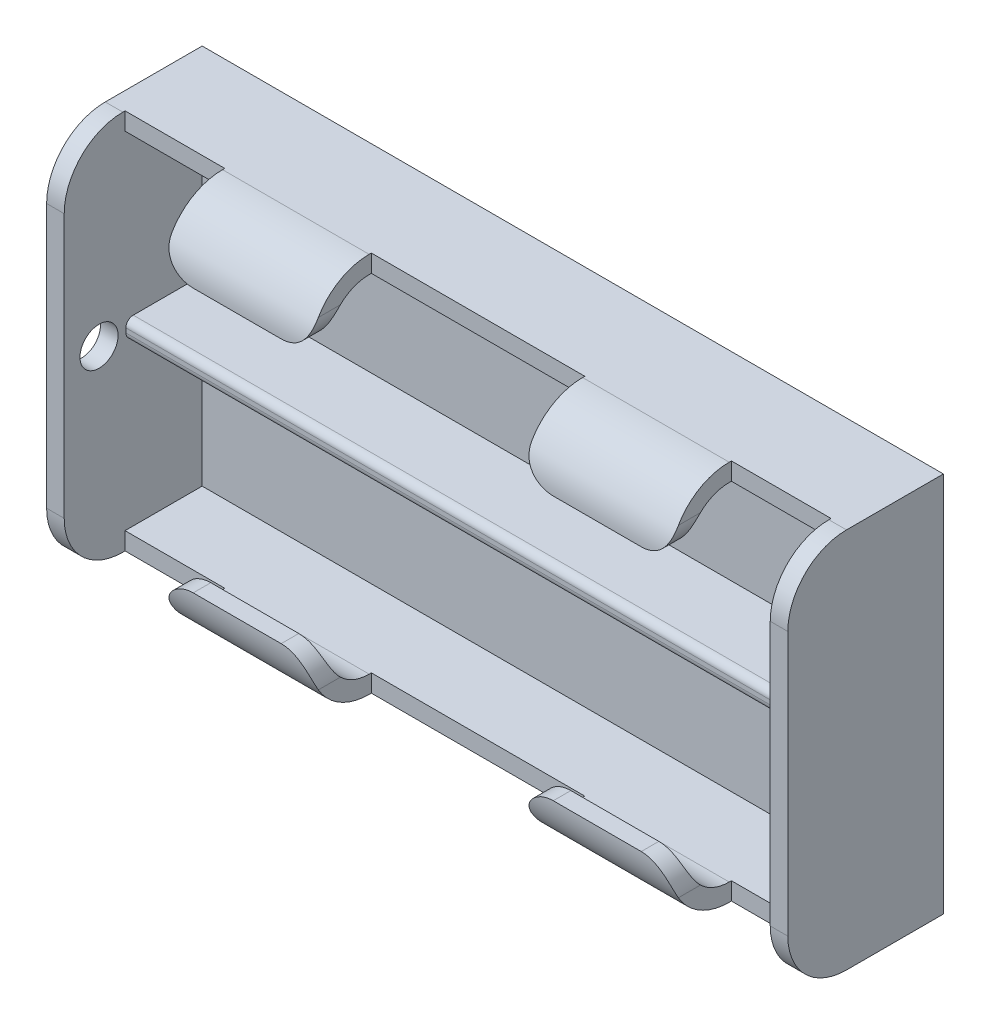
ISO-10303-21;
HEADER;
FILE_DESCRIPTION(('STEP AP214'),'2;1');
FILE_NAME('part.step','',(''),(''),'','','');
FILE_SCHEMA(('AUTOMOTIVE_DESIGN { 1 0 10303 214 1 1 1 1 }'));
ENDSEC;
DATA;
#1=APPLICATION_CONTEXT('core data for automotive mechanical design processes');
#2=APPLICATION_PROTOCOL_DEFINITION('international standard','automotive_design',2000,#1);
#3=PRODUCT_CONTEXT('',#1,'mechanical');
#4=PRODUCT('Part','Part','',(#3));
#5=PRODUCT_RELATED_PRODUCT_CATEGORY('part','',(#4));
#6=PRODUCT_DEFINITION_FORMATION('','',#4);
#7=PRODUCT_DEFINITION_CONTEXT('part definition',#1,'design');
#8=PRODUCT_DEFINITION('design','',#6,#7);
#9=PRODUCT_DEFINITION_SHAPE('','',#8);
#10=(LENGTH_UNIT() NAMED_UNIT(*) SI_UNIT(.MILLI.,.METRE.));
#11=(NAMED_UNIT(*) PLANE_ANGLE_UNIT() SI_UNIT($,.RADIAN.));
#12=(NAMED_UNIT(*) SI_UNIT($,.STERADIAN.) SOLID_ANGLE_UNIT());
#13=UNCERTAINTY_MEASURE_WITH_UNIT(LENGTH_MEASURE(1.E-05),#10,'distance_accuracy_value','');
#14=(GEOMETRIC_REPRESENTATION_CONTEXT(3) GLOBAL_UNCERTAINTY_ASSIGNED_CONTEXT((#13)) GLOBAL_UNIT_ASSIGNED_CONTEXT((#10,
#11,#12)) REPRESENTATION_CONTEXT('',''));
#15=CARTESIAN_POINT('',(0.,0.,0.));
#16=DIRECTION('',(0.,0.,1.));
#17=DIRECTION('',(1.,0.,0.));
#18=AXIS2_PLACEMENT_3D('',#15,#16,#17);
#19=CARTESIAN_POINT('',(0.,22.,-4.));
#20=DIRECTION('',(1.,0.,0.));
#21=DIRECTION('',(0.,0.,-1.));
#22=AXIS2_PLACEMENT_3D('',#19,#20,#21);
#23=CYLINDRICAL_SURFACE('',#22,4.);
#24=CARTESIAN_POINT('',(1.2,22.,-4.));
#25=DIRECTION('',(-1.,0.,0.));
#26=DIRECTION('',(0.,0.,1.));
#27=AXIS2_PLACEMENT_3D('',#24,#25,#26);
#28=CIRCLE('',#27,4.);
#29=CARTESIAN_POINT('',(1.19999999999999,26.,-4.));
#30=VERTEX_POINT('',#29);
#31=CARTESIAN_POINT('',(1.2,22.,0.));
#32=VERTEX_POINT('',#31);
#33=EDGE_CURVE('E476',#30,#32,#28,.F.);
#34=ORIENTED_EDGE('',*,*,#33,.F.);
#35=DIRECTION('',(-1.,0.,0.));
#36=VECTOR('',#35,1.);
#37=CARTESIAN_POINT('',(50.56,26.,-4.));
#38=LINE('',#37,#36);
#39=CARTESIAN_POINT('',(0.,26.,-4.));
#40=VERTEX_POINT('',#39);
#41=EDGE_CURVE('E599',#40,#30,#38,.F.);
#42=ORIENTED_EDGE('',*,*,#41,.F.);
#43=CARTESIAN_POINT('',(0.,22.,-4.));
#44=DIRECTION('',(-1.,0.,0.));
#45=DIRECTION('',(0.,0.,1.));
#46=AXIS2_PLACEMENT_3D('',#43,#44,#45);
#47=CIRCLE('',#46,4.);
#48=CARTESIAN_POINT('',(0.,22.,0.));
#49=VERTEX_POINT('',#48);
#50=EDGE_CURVE('E596',#49,#40,#47,.T.);
#51=ORIENTED_EDGE('',*,*,#50,.F.);
#52=DIRECTION('',(-1.,0.,0.));
#53=VECTOR('',#52,1.);
#54=CARTESIAN_POINT('',(0.,22.,0.));
#55=LINE('',#54,#53);
#56=EDGE_CURVE('E590',#32,#49,#55,.T.);
#57=ORIENTED_EDGE('',*,*,#56,.F.);
#58=EDGE_LOOP('',(#34,#42,#51,#57));
#59=FACE_BOUND('',#58,.T.);
#60=ADVANCED_FACE('F31',(#59),#23,.T.);
#61=CARTESIAN_POINT('',(8.,26.,-4.));
#62=VERTEX_POINT('',#61);
#63=CARTESIAN_POINT('',(18.,26.,-4.));
#64=VERTEX_POINT('',#63);
#65=EDGE_CURVE('E603',#62,#64,#38,.F.);
#66=ORIENTED_EDGE('',*,*,#65,.F.);
#67=CARTESIAN_POINT('',(8.,22.,-4.));
#68=DIRECTION('',(1.,0.,0.));
#69=DIRECTION('',(0.,0.,-1.));
#70=AXIS2_PLACEMENT_3D('',#67,#68,#69);
#71=CIRCLE('',#70,4.);
#72=CARTESIAN_POINT('',(8.,24.,-0.535898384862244));
#73=VERTEX_POINT('',#72);
#74=EDGE_CURVE('E499',#73,#62,#71,.F.);
#75=ORIENTED_EDGE('',*,*,#74,.F.);
#76=CARTESIAN_POINT('',(8.,24.,-0.535898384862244));
#77=CARTESIAN_POINT('',(7.99999499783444,23.9518293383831,-0.508077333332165));
#78=CARTESIAN_POINT('',(8.0017407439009,23.9030580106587,-0.481268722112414));
#79=CARTESIAN_POINT('',(8.00895421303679,23.8046317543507,-0.429793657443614));
#80=CARTESIAN_POINT('',(8.01442422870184,23.7549762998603,-0.40512853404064));
#81=CARTESIAN_POINT('',(8.02931734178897,23.6550921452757,-0.358060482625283));
#82=CARTESIAN_POINT('',(8.03874578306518,23.6048627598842,-0.335660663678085));
#83=CARTESIAN_POINT('',(8.06170187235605,23.5043558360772,-0.293263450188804));
#84=CARTESIAN_POINT('',(8.07522861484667,23.454078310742,-0.273265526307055));
#85=CARTESIAN_POINT('',(8.12227634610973,23.3034309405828,-0.216808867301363));
#86=CARTESIAN_POINT('',(8.16221971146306,23.2035670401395,-0.184036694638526));
#87=CARTESIAN_POINT('',(8.25900207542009,23.0097190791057,-0.128222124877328));
#88=CARTESIAN_POINT('',(8.31581502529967,22.9157262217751,-0.105164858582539));
#89=CARTESIAN_POINT('',(8.44125821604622,22.7425932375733,-0.0685969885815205));
#90=CARTESIAN_POINT('',(8.50899262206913,22.6629038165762,-0.0546030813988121));
#91=CARTESIAN_POINT('',(8.6565979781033,22.5146640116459,-0.0325381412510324));
#92=CARTESIAN_POINT('',(8.73647658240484,22.4461207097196,-0.0244708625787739));
#93=CARTESIAN_POINT('',(8.9075943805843,22.321294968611,-0.0124220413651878));
#94=CARTESIAN_POINT('',(8.99899877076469,22.2652326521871,-0.00850985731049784));
#95=CARTESIAN_POINT('',(9.18962638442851,22.1684076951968,-0.00325153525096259));
#96=CARTESIAN_POINT('',(9.28884972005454,22.1276452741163,-0.0019054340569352));
#97=CARTESIAN_POINT('',(9.48900172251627,22.0636321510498,-0.000381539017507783));
#98=CARTESIAN_POINT('',(9.58974877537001,22.03981783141,-0.000164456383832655));
#99=CARTESIAN_POINT('',(9.74263960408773,22.0159543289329,-2.49546982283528E-05));
#100=CARTESIAN_POINT('',(9.7939207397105,22.0099761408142,-9.50803521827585E-06));
#101=CARTESIAN_POINT('',(9.89679443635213,22.0019989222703,5.45550316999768E-07));
#102=CARTESIAN_POINT('',(9.9483870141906,22.000000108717,-4.84866291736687E-06));
#103=CARTESIAN_POINT('',(10.,22.,0.));
#104=B_SPLINE_CURVE_WITH_KNOTS('',3,(#76,#77,#78,#79,#80,#81,#82,#83,#84,#85,#86,#87,#88,#89,
#90,#91,#92,#93,#94,#95,#96,#97,#98,#99,#100,#101,#102,#103),.UNSPECIFIED.,.F.,.F.,(4,2,2,2,2,2,
2,2,2,2,2,2,2,4),(0.,0.166862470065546,0.333827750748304,0.501019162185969,0.668173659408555,
1.00353843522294,1.33838803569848,1.65346616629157,1.96874371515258,2.28920505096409,
2.60967098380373,2.91890658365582,3.07365783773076,3.22841752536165),.UNSPECIFIED.);
#105=CARTESIAN_POINT('',(10.,22.,0.));
#106=VERTEX_POINT('',#105);
#107=EDGE_CURVE('E760',#73,#106,#104,.T.);
#108=ORIENTED_EDGE('',*,*,#107,.T.);
#109=DIRECTION('',(-1.,0.,0.));
#110=VECTOR('',#109,1.);
#111=CARTESIAN_POINT('',(0.,22.,0.));
#112=LINE('',#111,#110);
#113=CARTESIAN_POINT('',(16.,22.,0.));
#114=VERTEX_POINT('',#113);
#115=EDGE_CURVE('E511',#114,#106,#112,.T.);
#116=ORIENTED_EDGE('',*,*,#115,.F.);
#117=CARTESIAN_POINT('',(16.,22.,0.));
#118=CARTESIAN_POINT('',(16.0561136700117,21.9999946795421,-8.750365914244E-06));
#119=CARTESIAN_POINT('',(16.1122247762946,22.0023615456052,-2.27188128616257E-07));
#120=CARTESIAN_POINT('',(16.2240480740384,22.0117984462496,-1.23040686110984E-05));
#121=CARTESIAN_POINT('',(16.2797602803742,22.0188683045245,-3.29030351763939E-05));
#122=CARTESIAN_POINT('',(16.3903794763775,22.0376671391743,-0.000166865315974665));
#123=CARTESIAN_POINT('',(16.4452867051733,22.049394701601,-0.000280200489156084));
#124=CARTESIAN_POINT('',(16.5539065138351,22.0774137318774,-0.000724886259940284));
#125=CARTESIAN_POINT('',(16.6076191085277,22.0937051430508,-0.00105623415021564));
#126=CARTESIAN_POINT('',(16.7664621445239,22.1492988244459,-0.00261233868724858));
#127=CARTESIAN_POINT('',(16.8693274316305,22.1953255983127,-0.00439903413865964));
#128=CARTESIAN_POINT('',(17.0657510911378,22.303892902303,-0.0111923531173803));
#129=CARTESIAN_POINT('',(17.1593109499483,22.36643078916,-0.0161984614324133));
#130=CARTESIAN_POINT('',(17.3335146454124,22.5053393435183,-0.0314422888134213));
#131=CARTESIAN_POINT('',(17.414281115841,22.5815615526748,-0.0416258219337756));
#132=CARTESIAN_POINT('',(17.5615457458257,22.7455272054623,-0.0692148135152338));
#133=CARTESIAN_POINT('',(17.6280551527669,22.8332614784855,-0.0866145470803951));
#134=CARTESIAN_POINT('',(17.7426571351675,23.0130629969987,-0.129356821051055));
#135=CARTESIAN_POINT('',(17.7913929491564,23.1048051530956,-0.154344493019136));
#136=CARTESIAN_POINT('',(17.8734223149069,23.29234454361,-0.213246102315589));
#137=CARTESIAN_POINT('',(17.9067001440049,23.3881457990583,-0.247169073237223));
#138=CARTESIAN_POINT('',(17.9556009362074,23.5713190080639,-0.320357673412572));
#139=CARTESIAN_POINT('',(17.9725740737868,23.6586494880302,-0.358836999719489));
#140=CARTESIAN_POINT('',(17.9892221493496,23.7881245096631,-0.421603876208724));
#141=CARTESIAN_POINT('',(17.9933031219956,23.8309998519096,-0.443350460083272));
#142=CARTESIAN_POINT('',(17.9986915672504,23.9160606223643,-0.4884434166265));
#143=CARTESIAN_POINT('',(18.0000000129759,23.9582462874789,-0.511789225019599));
#144=CARTESIAN_POINT('',(18.,24.,-0.535898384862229));
#145=B_SPLINE_CURVE_WITH_KNOTS('',3,(#117,#118,#119,#120,#121,#122,#123,#124,#125,#126,#127,
#128,#129,#130,#131,#132,#133,#134,#135,#136,#137,#138,#139,#140,#141,#142,#143,#144),
.UNSPECIFIED.,.F.,.F.,(4,2,2,2,2,2,2,2,2,2,2,2,2,4),(0.,0.168286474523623,0.336566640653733,
0.504795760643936,0.673022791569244,1.00938791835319,1.34569922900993,1.67856108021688,
2.01115936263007,2.33012237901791,2.64940911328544,2.9391109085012,3.0837589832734,
3.22835628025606),.UNSPECIFIED.);
#146=CARTESIAN_POINT('',(18.,24.,-0.535898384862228));
#147=VERTEX_POINT('',#146);
#148=EDGE_CURVE('E755',#114,#147,#145,.T.);
#149=ORIENTED_EDGE('',*,*,#148,.T.);
#150=CARTESIAN_POINT('',(18.,22.,-4.));
#151=DIRECTION('',(-1.,0.,0.));
#152=DIRECTION('',(0.,-1.,0.));
#153=AXIS2_PLACEMENT_3D('',#150,#151,#152);
#154=CIRCLE('',#153,4.);
#155=EDGE_CURVE('E496',#64,#147,#154,.F.);
#156=ORIENTED_EDGE('',*,*,#155,.F.);
#157=EDGE_LOOP('',(#66,#75,#108,#116,#149,#156));
#158=FACE_BOUND('',#157,.T.);
#159=ADVANCED_FACE('F859',(#158),#23,.T.);
#160=CARTESIAN_POINT('',(32.56,26.,-4.));
#161=VERTEX_POINT('',#160);
#162=CARTESIAN_POINT('',(42.56,26.,-4.));
#163=VERTEX_POINT('',#162);
#164=EDGE_CURVE('E885',#161,#163,#38,.F.);
#165=ORIENTED_EDGE('',*,*,#164,.F.);
#166=CARTESIAN_POINT('',(32.56,22.,-4.));
#167=DIRECTION('',(1.,0.,0.));
#168=DIRECTION('',(0.,1.,0.));
#169=AXIS2_PLACEMENT_3D('',#166,#167,#168);
#170=CIRCLE('',#169,4.);
#171=CARTESIAN_POINT('',(32.56,24.,-0.535898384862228));
#172=VERTEX_POINT('',#171);
#173=EDGE_CURVE('E494',#172,#161,#170,.F.);
#174=ORIENTED_EDGE('',*,*,#173,.F.);
#175=CARTESIAN_POINT('',(32.56,24.,-0.535898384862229));
#176=CARTESIAN_POINT('',(32.5599949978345,23.951829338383,-0.508077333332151));
#177=CARTESIAN_POINT('',(32.5617407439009,23.9030580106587,-0.481268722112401));
#178=CARTESIAN_POINT('',(32.5689542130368,23.8046317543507,-0.429793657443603));
#179=CARTESIAN_POINT('',(32.5744242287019,23.7549762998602,-0.405128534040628));
#180=CARTESIAN_POINT('',(32.589317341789,23.6550921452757,-0.358060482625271));
#181=CARTESIAN_POINT('',(32.5987457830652,23.6048627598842,-0.335660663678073));
#182=CARTESIAN_POINT('',(32.6217018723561,23.5043558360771,-0.293263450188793));
#183=CARTESIAN_POINT('',(32.6352286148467,23.454078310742,-0.273265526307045));
#184=CARTESIAN_POINT('',(32.6822763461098,23.3034309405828,-0.216808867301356));
#185=CARTESIAN_POINT('',(32.7222197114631,23.2035670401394,-0.18403669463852));
#186=CARTESIAN_POINT('',(32.8190020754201,23.0097190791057,-0.128222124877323));
#187=CARTESIAN_POINT('',(32.8758150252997,22.915726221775,-0.105164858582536));
#188=CARTESIAN_POINT('',(33.0012582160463,22.7425932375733,-0.068596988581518));
#189=CARTESIAN_POINT('',(33.0689926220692,22.6629038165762,-0.05460308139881));
#190=CARTESIAN_POINT('',(33.2165979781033,22.5146640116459,-0.0325381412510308));
#191=CARTESIAN_POINT('',(33.2964765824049,22.4461207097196,-0.0244708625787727));
#192=CARTESIAN_POINT('',(33.4675943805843,22.321294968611,-0.012422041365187));
#193=CARTESIAN_POINT('',(33.5589987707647,22.2652326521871,-0.00850985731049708));
#194=CARTESIAN_POINT('',(33.7496263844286,22.1684076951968,-0.00325153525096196));
#195=CARTESIAN_POINT('',(33.8488497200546,22.1276452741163,-0.00190543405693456));
#196=CARTESIAN_POINT('',(34.0490017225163,22.0636321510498,-0.00038153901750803));
#197=CARTESIAN_POINT('',(34.14974877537,22.03981783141,-0.00016445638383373));
#198=CARTESIAN_POINT('',(34.3026396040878,22.0159543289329,-2.49546982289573E-05));
#199=CARTESIAN_POINT('',(34.3539207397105,22.0099761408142,-9.50803521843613E-06));
#200=CARTESIAN_POINT('',(34.4567944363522,22.0019989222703,5.45550317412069E-07));
#201=CARTESIAN_POINT('',(34.5083870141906,22.000000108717,-4.84866291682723E-06));
#202=CARTESIAN_POINT('',(34.56,22.,0.));
#203=B_SPLINE_CURVE_WITH_KNOTS('',3,(#175,#176,#177,#178,#179,#180,#181,#182,#183,#184,#185,
#186,#187,#188,#189,#190,#191,#192,#193,#194,#195,#196,#197,#198,#199,#200,#201,#202),
.UNSPECIFIED.,.F.,.F.,(4,2,2,2,2,2,2,2,2,2,2,2,2,4),(0.,0.166862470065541,0.333827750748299,
0.501019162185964,0.668173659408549,1.00353843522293,1.33838803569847,1.65346616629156,
1.96874371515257,2.28920505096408,2.60967098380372,2.91890658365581,3.07365783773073,
3.22841752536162),.UNSPECIFIED.);
#204=CARTESIAN_POINT('',(34.56,22.,0.));
#205=VERTEX_POINT('',#204);
#206=EDGE_CURVE('E669',#172,#205,#203,.T.);
#207=ORIENTED_EDGE('',*,*,#206,.T.);
#208=CARTESIAN_POINT('',(40.56,22.,0.));
#209=VERTEX_POINT('',#208);
#210=EDGE_CURVE('E507',#209,#205,#112,.T.);
#211=ORIENTED_EDGE('',*,*,#210,.F.);
#212=CARTESIAN_POINT('',(40.56,22.,0.));
#213=CARTESIAN_POINT('',(40.6161136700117,21.9999946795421,-8.7503659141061E-06));
#214=CARTESIAN_POINT('',(40.6722247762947,22.0023615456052,-2.27188128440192E-07));
#215=CARTESIAN_POINT('',(40.7840480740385,22.0117984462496,-1.23040686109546E-05));
#216=CARTESIAN_POINT('',(40.8397602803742,22.0188683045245,-3.29030351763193E-05));
#217=CARTESIAN_POINT('',(40.9503794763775,22.0376671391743,-0.000166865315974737));
#218=CARTESIAN_POINT('',(41.0052867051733,22.049394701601,-0.000280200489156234));
#219=CARTESIAN_POINT('',(41.1139065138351,22.0774137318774,-0.000724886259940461));
#220=CARTESIAN_POINT('',(41.1676191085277,22.0937051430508,-0.00105623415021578));
#221=CARTESIAN_POINT('',(41.3264621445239,22.1492988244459,-0.00261233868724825));
#222=CARTESIAN_POINT('',(41.4293274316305,22.1953255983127,-0.00439903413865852));
#223=CARTESIAN_POINT('',(41.6257510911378,22.303892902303,-0.0111923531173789));
#224=CARTESIAN_POINT('',(41.7193109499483,22.36643078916,-0.0161984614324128));
#225=CARTESIAN_POINT('',(41.8935146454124,22.5053393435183,-0.0314422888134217));
#226=CARTESIAN_POINT('',(41.974281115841,22.5815615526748,-0.0416258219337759));
#227=CARTESIAN_POINT('',(42.1215457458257,22.7455272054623,-0.069214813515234));
#228=CARTESIAN_POINT('',(42.1880551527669,22.8332614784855,-0.0866145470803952));
#229=CARTESIAN_POINT('',(42.3026571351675,23.0130629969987,-0.129356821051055));
#230=CARTESIAN_POINT('',(42.3513929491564,23.1048051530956,-0.154344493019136));
#231=CARTESIAN_POINT('',(42.4334223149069,23.29234454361,-0.21324610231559));
#232=CARTESIAN_POINT('',(42.4667001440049,23.3881457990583,-0.247169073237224));
#233=CARTESIAN_POINT('',(42.5156009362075,23.5713190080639,-0.320357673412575));
#234=CARTESIAN_POINT('',(42.5325740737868,23.6586494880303,-0.358836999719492));
#235=CARTESIAN_POINT('',(42.5492221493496,23.7881245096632,-0.421603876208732));
#236=CARTESIAN_POINT('',(42.5533031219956,23.8309998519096,-0.443350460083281));
#237=CARTESIAN_POINT('',(42.5586915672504,23.9160606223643,-0.488443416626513));
#238=CARTESIAN_POINT('',(42.5600000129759,23.958246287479,-0.511789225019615));
#239=CARTESIAN_POINT('',(42.56,24.,-0.535898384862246));
#240=B_SPLINE_CURVE_WITH_KNOTS('',3,(#212,#213,#214,#215,#216,#217,#218,#219,#220,#221,#222,
#223,#224,#225,#226,#227,#228,#229,#230,#231,#232,#233,#234,#235,#236,#237,#238,#239),
.UNSPECIFIED.,.F.,.F.,(4,2,2,2,2,2,2,2,2,2,2,2,2,4),(0.,0.168286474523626,0.336566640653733,
0.504795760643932,0.673022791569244,1.00938791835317,1.34569922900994,1.67856108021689,
2.01115936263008,2.3301223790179,2.64940911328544,2.93911090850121,3.08375898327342,
3.2283562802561),.UNSPECIFIED.);
#241=CARTESIAN_POINT('',(42.56,24.,-0.535898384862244));
#242=VERTEX_POINT('',#241);
#243=EDGE_CURVE('E676',#209,#242,#240,.T.);
#244=ORIENTED_EDGE('',*,*,#243,.T.);
#245=CARTESIAN_POINT('',(42.56,22.,-4.));
#246=DIRECTION('',(-1.,0.,0.));
#247=DIRECTION('',(0.,0.,1.));
#248=AXIS2_PLACEMENT_3D('',#245,#246,#247);
#249=CIRCLE('',#248,4.);
#250=EDGE_CURVE('E491',#163,#242,#249,.F.);
#251=ORIENTED_EDGE('',*,*,#250,.F.);
#252=EDGE_LOOP('',(#165,#174,#207,#211,#244,#251));
#253=FACE_BOUND('',#252,.T.);
#254=ADVANCED_FACE('F864',(#253),#23,.T.);
#255=CARTESIAN_POINT('',(0.,4.,-4.));
#256=DIRECTION('',(-1.,0.,0.));
#257=DIRECTION('',(0.,0.,1.));
#258=AXIS2_PLACEMENT_3D('',#255,#256,#257);
#259=CYLINDRICAL_SURFACE('',#258,4.);
#260=CARTESIAN_POINT('',(49.36,4.,-4.));
#261=DIRECTION('',(1.,0.,0.));
#262=DIRECTION('',(0.,0.,-1.));
#263=AXIS2_PLACEMENT_3D('',#260,#261,#262);
#264=CIRCLE('',#263,4.);
#265=CARTESIAN_POINT('',(49.36,0.,-4.));
#266=VERTEX_POINT('',#265);
#267=CARTESIAN_POINT('',(49.36,4.,0.));
#268=VERTEX_POINT('',#267);
#269=EDGE_CURVE('E487',#266,#268,#264,.F.);
#270=ORIENTED_EDGE('',*,*,#269,.F.);
#271=DIRECTION('',(1.,0.,0.));
#272=VECTOR('',#271,1.);
#273=CARTESIAN_POINT('',(0.,0.,-4.));
#274=LINE('',#273,#272);
#275=CARTESIAN_POINT('',(50.56,0.,-4.));
#276=VERTEX_POINT('',#275);
#277=EDGE_CURVE('E608',#276,#266,#274,.F.);
#278=ORIENTED_EDGE('',*,*,#277,.F.);
#279=CARTESIAN_POINT('',(50.56,4.,-4.));
#280=DIRECTION('',(1.,0.,0.));
#281=DIRECTION('',(0.,0.,-1.));
#282=AXIS2_PLACEMENT_3D('',#279,#280,#281);
#283=CIRCLE('',#282,4.);
#284=CARTESIAN_POINT('',(50.56,4.,0.));
#285=VERTEX_POINT('',#284);
#286=EDGE_CURVE('E602',#285,#276,#283,.T.);
#287=ORIENTED_EDGE('',*,*,#286,.F.);
#288=DIRECTION('',(1.,0.,0.));
#289=VECTOR('',#288,1.);
#290=CARTESIAN_POINT('',(50.56,4.,0.));
#291=LINE('',#290,#289);
#292=EDGE_CURVE('E578',#268,#285,#291,.T.);
#293=ORIENTED_EDGE('',*,*,#292,.F.);
#294=EDGE_LOOP('',(#270,#278,#287,#293));
#295=FACE_BOUND('',#294,.T.);
#296=ADVANCED_FACE('F831',(#295),#259,.T.);
#297=CARTESIAN_POINT('',(42.56,0.,-4.));
#298=VERTEX_POINT('',#297);
#299=CARTESIAN_POINT('',(32.56,0.,-4.));
#300=VERTEX_POINT('',#299);
#301=EDGE_CURVE('E612',#298,#300,#274,.F.);
#302=ORIENTED_EDGE('',*,*,#301,.F.);
#303=CARTESIAN_POINT('',(42.56,4.,-4.));
#304=DIRECTION('',(-1.,0.,0.));
#305=DIRECTION('',(0.,0.,1.));
#306=AXIS2_PLACEMENT_3D('',#303,#304,#305);
#307=CIRCLE('',#306,4.);
#308=CARTESIAN_POINT('',(42.56,2.,-0.535898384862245));
#309=VERTEX_POINT('',#308);
#310=EDGE_CURVE('E485',#309,#298,#307,.F.);
#311=ORIENTED_EDGE('',*,*,#310,.F.);
#312=CARTESIAN_POINT('',(42.56,2.,-0.535898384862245));
#313=CARTESIAN_POINT('',(42.5600050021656,2.04817066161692,-0.508077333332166));
#314=CARTESIAN_POINT('',(42.5582592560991,2.09694198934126,-0.481268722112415));
#315=CARTESIAN_POINT('',(42.5510457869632,2.1953682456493,-0.429793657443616));
#316=CARTESIAN_POINT('',(42.5455757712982,2.24502370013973,-0.405128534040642));
#317=CARTESIAN_POINT('',(42.530682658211,2.34490785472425,-0.358060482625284));
#318=CARTESIAN_POINT('',(42.5212542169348,2.3951372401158,-0.335660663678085));
#319=CARTESIAN_POINT('',(42.4982981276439,2.49564416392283,-0.293263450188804));
#320=CARTESIAN_POINT('',(42.4847713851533,2.545921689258,-0.273265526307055));
#321=CARTESIAN_POINT('',(42.4377236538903,2.69656905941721,-0.216808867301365));
#322=CARTESIAN_POINT('',(42.3977802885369,2.79643295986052,-0.184036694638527));
#323=CARTESIAN_POINT('',(42.3009979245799,2.99028092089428,-0.128222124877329));
#324=CARTESIAN_POINT('',(42.2441849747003,3.08427377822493,-0.10516485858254));
#325=CARTESIAN_POINT('',(42.1187417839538,3.2574067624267,-0.0685969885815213));
#326=CARTESIAN_POINT('',(42.0510073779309,3.33709618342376,-0.0546030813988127));
#327=CARTESIAN_POINT('',(41.9034020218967,3.48533598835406,-0.0325381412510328));
#328=CARTESIAN_POINT('',(41.8235234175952,3.55387929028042,-0.0244708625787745));
#329=CARTESIAN_POINT('',(41.6524056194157,3.67870503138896,-0.0124220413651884));
#330=CARTESIAN_POINT('',(41.5610012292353,3.73476734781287,-0.00850985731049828));
#331=CARTESIAN_POINT('',(41.3703736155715,3.83159230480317,-0.00325153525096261));
#332=CARTESIAN_POINT('',(41.2711502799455,3.87235472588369,-0.00190543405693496));
#333=CARTESIAN_POINT('',(41.0709982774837,3.93636784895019,-0.000381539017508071));
#334=CARTESIAN_POINT('',(40.97025122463,3.96018216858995,-0.000164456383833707));
#335=CARTESIAN_POINT('',(40.8173603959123,3.98404567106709,-2.49546982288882E-05));
#336=CARTESIAN_POINT('',(40.7660792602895,3.99002385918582,-9.50803521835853E-06));
#337=CARTESIAN_POINT('',(40.6632055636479,3.99800107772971,5.45550317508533E-07));
#338=CARTESIAN_POINT('',(40.6116129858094,3.99999989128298,-4.84866291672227E-06));
#339=CARTESIAN_POINT('',(40.56,4.,0.));
#340=B_SPLINE_CURVE_WITH_KNOTS('',3,(#312,#313,#314,#315,#316,#317,#318,#319,#320,#321,#322,
#323,#324,#325,#326,#327,#328,#329,#330,#331,#332,#333,#334,#335,#336,#337,#338,#339),
.UNSPECIFIED.,.F.,.F.,(4,2,2,2,2,2,2,2,2,2,2,2,2,4),(0.,0.166862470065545,0.333827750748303,
0.501019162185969,0.668173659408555,1.00353843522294,1.33838803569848,1.65346616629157,
1.96874371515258,2.28920505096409,2.60967098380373,2.91890658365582,3.07365783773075,
3.22841752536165),.UNSPECIFIED.);
#341=CARTESIAN_POINT('',(40.56,4.,0.));
#342=VERTEX_POINT('',#341);
#343=EDGE_CURVE('E837',#309,#342,#340,.T.);
#344=ORIENTED_EDGE('',*,*,#343,.T.);
#345=DIRECTION('',(1.,0.,0.));
#346=VECTOR('',#345,1.);
#347=CARTESIAN_POINT('',(50.56,4.,0.));
#348=LINE('',#347,#346);
#349=CARTESIAN_POINT('',(34.56,4.,0.));
#350=VERTEX_POINT('',#349);
#351=EDGE_CURVE('E502',#350,#342,#348,.T.);
#352=ORIENTED_EDGE('',*,*,#351,.F.);
#353=CARTESIAN_POINT('',(34.56,4.,0.));
#354=CARTESIAN_POINT('',(34.5038863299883,4.0000053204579,-8.75036591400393E-06));
#355=CARTESIAN_POINT('',(34.4477752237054,3.9976384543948,-2.27188128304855E-07));
#356=CARTESIAN_POINT('',(34.3359519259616,3.98820155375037,-1.23040686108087E-05));
#357=CARTESIAN_POINT('',(34.2802397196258,3.98113169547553,-3.29030351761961E-05));
#358=CARTESIAN_POINT('',(34.1696205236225,3.96233286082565,-0.000166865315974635));
#359=CARTESIAN_POINT('',(34.1147132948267,3.95060529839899,-0.000280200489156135));
#360=CARTESIAN_POINT('',(34.006093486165,3.92258626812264,-0.000724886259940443));
#361=CARTESIAN_POINT('',(33.9523808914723,3.90629485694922,-0.00105623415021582));
#362=CARTESIAN_POINT('',(33.7935378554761,3.85070117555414,-0.00261233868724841));
#363=CARTESIAN_POINT('',(33.6906725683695,3.80467440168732,-0.00439903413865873));
#364=CARTESIAN_POINT('',(33.4942489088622,3.69610709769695,-0.0111923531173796));
#365=CARTESIAN_POINT('',(33.4006890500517,3.63356921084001,-0.0161984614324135));
#366=CARTESIAN_POINT('',(33.2264853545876,3.49466065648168,-0.0314422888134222));
#367=CARTESIAN_POINT('',(33.145718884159,3.41843844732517,-0.0416258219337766));
#368=CARTESIAN_POINT('',(32.9984542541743,3.25447279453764,-0.0692148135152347));
#369=CARTESIAN_POINT('',(32.9319448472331,3.16673852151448,-0.086614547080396));
#370=CARTESIAN_POINT('',(32.8173428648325,2.98693700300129,-0.129356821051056));
#371=CARTESIAN_POINT('',(32.7686070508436,2.89519484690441,-0.154344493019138));
#372=CARTESIAN_POINT('',(32.6865776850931,2.70765545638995,-0.213246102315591));
#373=CARTESIAN_POINT('',(32.6532998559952,2.61185420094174,-0.247169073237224));
#374=CARTESIAN_POINT('',(32.6043990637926,2.42868099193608,-0.320357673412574));
#375=CARTESIAN_POINT('',(32.5874259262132,2.34135051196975,-0.358836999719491));
#376=CARTESIAN_POINT('',(32.5707778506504,2.21187549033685,-0.421603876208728));
#377=CARTESIAN_POINT('',(32.5666968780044,2.16900014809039,-0.443350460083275));
#378=CARTESIAN_POINT('',(32.5613084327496,2.08393937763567,-0.488443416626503));
#379=CARTESIAN_POINT('',(32.5599999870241,2.04175371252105,-0.511789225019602));
#380=CARTESIAN_POINT('',(32.56,2.00000000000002,-0.535898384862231));
#381=B_SPLINE_CURVE_WITH_KNOTS('',3,(#353,#354,#355,#356,#357,#358,#359,#360,#361,#362,#363,
#364,#365,#366,#367,#368,#369,#370,#371,#372,#373,#374,#375,#376,#377,#378,#379,#380),
.UNSPECIFIED.,.F.,.F.,(4,2,2,2,2,2,2,2,2,2,2,2,2,4),(0.,0.168286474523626,0.336566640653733,
0.504795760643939,0.673022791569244,1.00938791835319,1.34569922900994,1.67856108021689,
2.01115936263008,2.33012237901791,2.64940911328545,2.9391109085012,3.08375898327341,
3.22835628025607),.UNSPECIFIED.);
#382=CARTESIAN_POINT('',(32.56,2.00000000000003,-0.53589838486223));
#383=VERTEX_POINT('',#382);
#384=EDGE_CURVE('E820',#350,#383,#381,.T.);
#385=ORIENTED_EDGE('',*,*,#384,.T.);
#386=CARTESIAN_POINT('',(32.56,4.,-4.));
#387=DIRECTION('',(1.,0.,0.));
#388=DIRECTION('',(0.,1.,0.));
#389=AXIS2_PLACEMENT_3D('',#386,#387,#388);
#390=CIRCLE('',#389,4.);
#391=EDGE_CURVE('E482',#300,#383,#390,.F.);
#392=ORIENTED_EDGE('',*,*,#391,.F.);
#393=EDGE_LOOP('',(#302,#311,#344,#352,#385,#392));
#394=FACE_BOUND('',#393,.T.);
#395=ADVANCED_FACE('F880',(#394),#259,.T.);
#396=CARTESIAN_POINT('',(1.19999999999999,0.,-4.));
#397=VERTEX_POINT('',#396);
#398=CARTESIAN_POINT('',(0.,0.,-4.));
#399=VERTEX_POINT('',#398);
#400=EDGE_CURVE('E607',#397,#399,#274,.F.);
#401=ORIENTED_EDGE('',*,*,#400,.F.);
#402=CARTESIAN_POINT('',(1.2,4.,-4.));
#403=DIRECTION('',(-1.,0.,0.));
#404=DIRECTION('',(0.,0.,1.));
#405=AXIS2_PLACEMENT_3D('',#402,#403,#404);
#406=CIRCLE('',#405,4.);
#407=CARTESIAN_POINT('',(1.2,4.,0.));
#408=VERTEX_POINT('',#407);
#409=EDGE_CURVE('E474',#408,#397,#406,.F.);
#410=ORIENTED_EDGE('',*,*,#409,.F.);
#411=CARTESIAN_POINT('',(0.,4.,0.));
#412=VERTEX_POINT('',#411);
#413=EDGE_CURVE('E587',#412,#408,#291,.T.);
#414=ORIENTED_EDGE('',*,*,#413,.F.);
#415=CARTESIAN_POINT('',(0.,4.,-4.));
#416=DIRECTION('',(-1.,0.,0.));
#417=DIRECTION('',(0.,0.,1.));
#418=AXIS2_PLACEMENT_3D('',#415,#416,#417);
#419=CIRCLE('',#418,4.);
#420=EDGE_CURVE('E594',#399,#412,#419,.T.);
#421=ORIENTED_EDGE('',*,*,#420,.F.);
#422=EDGE_LOOP('',(#401,#410,#414,#421));
#423=FACE_BOUND('',#422,.T.);
#424=ADVANCED_FACE('F832',(#423),#259,.T.);
#425=CARTESIAN_POINT('',(1.2,0.,-10.61));
#426=DIRECTION('',(-1.,0.,0.));
#427=DIRECTION('',(0.,0.,1.));
#428=AXIS2_PLACEMENT_3D('',#425,#426,#427);
#429=PLANE('',#428);
#430=CARTESIAN_POINT('',(1.2,12.9800772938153,-2.37636219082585));
#431=DIRECTION('',(-1.,0.,0.));
#432=DIRECTION('',(0.,0.,1.));
#433=AXIS2_PLACEMENT_3D('',#430,#431,#432);
#434=CIRCLE('',#433,1.3);
#435=CARTESIAN_POINT('',(1.2,12.9800772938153,-1.07636219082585));
#436=VERTEX_POINT('',#435);
#437=EDGE_CURVE('E1005',#436,#436,#434,.T.);
#438=ORIENTED_EDGE('',*,*,#437,.T.);
#439=EDGE_LOOP('',(#438));
#440=FACE_BOUND('',#439,.T.);
#441=DIRECTION('',(0.,0.,1.));
#442=VECTOR('',#441,1.);
#443=CARTESIAN_POINT('',(1.2,24.8,-10.61));
#444=LINE('',#443,#442);
#445=CARTESIAN_POINT('',(1.2,24.8,-9.41));
#446=VERTEX_POINT('',#445);
#447=CARTESIAN_POINT('',(1.2,24.8,-4.15));
#448=VERTEX_POINT('',#447);
#449=EDGE_CURVE('E506',#446,#448,#444,.T.);
#450=ORIENTED_EDGE('',*,*,#449,.T.);
#451=DIRECTION('',(0.,-1.,0.));
#452=VECTOR('',#451,1.);
#453=CARTESIAN_POINT('',(1.19999999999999,-1.64045460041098,-4.15));
#454=LINE('',#453,#452);
#455=CARTESIAN_POINT('',(1.19999999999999,26.,-4.15));
#456=VERTEX_POINT('',#455);
#457=EDGE_CURVE('E396',#456,#448,#454,.T.);
#458=ORIENTED_EDGE('',*,*,#457,.F.);
#459=DIRECTION('',(0.,0.,1.));
#460=VECTOR('',#459,1.);
#461=CARTESIAN_POINT('',(1.19999999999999,26.,-10.61));
#462=LINE('',#461,#460);
#463=EDGE_CURVE('E458',#456,#30,#462,.T.);
#464=ORIENTED_EDGE('',*,*,#463,.T.);
#465=ORIENTED_EDGE('',*,*,#33,.T.);
#466=DIRECTION('',(0.,-1.,0.));
#467=VECTOR('',#466,1.);
#468=CARTESIAN_POINT('',(1.2,0.,0.));
#469=LINE('',#468,#467);
#470=EDGE_CURVE('E501',#32,#408,#469,.T.);
#471=ORIENTED_EDGE('',*,*,#470,.T.);
#472=ORIENTED_EDGE('',*,*,#409,.T.);
#473=DIRECTION('',(0.,0.,-1.));
#474=VECTOR('',#473,1.);
#475=CARTESIAN_POINT('',(1.19999999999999,0.,-10.61));
#476=LINE('',#475,#474);
#477=CARTESIAN_POINT('',(1.19999999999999,0.,-4.15));
#478=VERTEX_POINT('',#477);
#479=EDGE_CURVE('E456',#397,#478,#476,.T.);
#480=ORIENTED_EDGE('',*,*,#479,.T.);
#481=CARTESIAN_POINT('',(1.19999999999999,1.2,-4.15));
#482=VERTEX_POINT('',#481);
#483=EDGE_CURVE('E379',#482,#478,#454,.T.);
#484=ORIENTED_EDGE('',*,*,#483,.F.);
#485=DIRECTION('',(0.,0.,1.));
#486=VECTOR('',#485,1.);
#487=CARTESIAN_POINT('',(1.2,1.2,-10.61));
#488=LINE('',#487,#486);
#489=CARTESIAN_POINT('',(1.2,1.2,-9.41));
#490=VERTEX_POINT('',#489);
#491=EDGE_CURVE('E519',#490,#482,#488,.T.);
#492=ORIENTED_EDGE('',*,*,#491,.F.);
#493=DIRECTION('',(0.,-1.,0.));
#494=VECTOR('',#493,1.);
#495=CARTESIAN_POINT('',(1.2,0.,-9.41));
#496=LINE('',#495,#494);
#497=CARTESIAN_POINT('',(1.2,12.35,-9.41));
#498=VERTEX_POINT('',#497);
#499=EDGE_CURVE('E518',#498,#490,#496,.T.);
#500=ORIENTED_EDGE('',*,*,#499,.F.);
#501=DIRECTION('',(0.,0.,-1.));
#502=VECTOR('',#501,1.);
#503=CARTESIAN_POINT('',(1.2,12.35,-10.61));
#504=LINE('',#503,#502);
#505=CARTESIAN_POINT('',(1.2,12.35,-4.71));
#506=VERTEX_POINT('',#505);
#507=EDGE_CURVE('E469',#506,#498,#504,.T.);
#508=ORIENTED_EDGE('',*,*,#507,.F.);
#509=CARTESIAN_POINT('',(1.2,12.85,-4.71));
#510=DIRECTION('',(-1.,0.,0.));
#511=DIRECTION('',(0.,0.,1.));
#512=AXIS2_PLACEMENT_3D('',#509,#510,#511);
#513=CIRCLE('',#512,0.5);
#514=CARTESIAN_POINT('',(1.2,12.85,-4.21));
#515=VERTEX_POINT('',#514);
#516=EDGE_CURVE('E657',#506,#515,#513,.T.);
#517=ORIENTED_EDGE('',*,*,#516,.T.);
#518=DIRECTION('',(0.,1.,0.));
#519=VECTOR('',#518,1.);
#520=CARTESIAN_POINT('',(1.2,0.,-4.21));
#521=LINE('',#520,#519);
#522=CARTESIAN_POINT('',(1.2,13.15,-4.21));
#523=VERTEX_POINT('',#522);
#524=EDGE_CURVE('E471',#515,#523,#521,.T.);
#525=ORIENTED_EDGE('',*,*,#524,.T.);
#526=CARTESIAN_POINT('',(1.2,13.15,-4.71));
#527=DIRECTION('',(-1.,0.,0.));
#528=DIRECTION('',(0.,0.,1.));
#529=AXIS2_PLACEMENT_3D('',#526,#527,#528);
#530=CIRCLE('',#529,0.5);
#531=CARTESIAN_POINT('',(1.2,13.65,-4.71));
#532=VERTEX_POINT('',#531);
#533=EDGE_CURVE('E659',#523,#532,#530,.T.);
#534=ORIENTED_EDGE('',*,*,#533,.T.);
#535=DIRECTION('',(0.,0.,1.));
#536=VECTOR('',#535,1.);
#537=CARTESIAN_POINT('',(1.2,13.65,-10.61));
#538=LINE('',#537,#536);
#539=CARTESIAN_POINT('',(1.2,13.65,-9.41));
#540=VERTEX_POINT('',#539);
#541=EDGE_CURVE('E463',#540,#532,#538,.T.);
#542=ORIENTED_EDGE('',*,*,#541,.F.);
#543=EDGE_CURVE('E515',#446,#540,#496,.T.);
#544=ORIENTED_EDGE('',*,*,#543,.F.);
#545=EDGE_LOOP('',(#450,#458,#464,#465,#471,#472,#480,#484,#492,#500,#508,#517,#525,#534,#542,#544));
#546=FACE_BOUND('',#545,.T.);
#547=ADVANCED_FACE('F1028',(#440,#546),#429,.F.);
#548=CARTESIAN_POINT('',(49.36,0.,-10.61));
#549=DIRECTION('',(1.,0.,0.));
#550=DIRECTION('',(0.,0.,-1.));
#551=AXIS2_PLACEMENT_3D('',#548,#549,#550);
#552=PLANE('',#551);
#553=DIRECTION('',(0.,0.,1.));
#554=VECTOR('',#553,1.);
#555=CARTESIAN_POINT('',(49.36,1.2,-10.61));
#556=LINE('',#555,#554);
#557=CARTESIAN_POINT('',(49.36,1.2,-9.41));
#558=VERTEX_POINT('',#557);
#559=CARTESIAN_POINT('',(49.36,1.2,-4.15));
#560=VERTEX_POINT('',#559);
#561=EDGE_CURVE('E522',#558,#560,#556,.T.);
#562=ORIENTED_EDGE('',*,*,#561,.T.);
#563=DIRECTION('',(0.,1.,0.));
#564=VECTOR('',#563,1.);
#565=CARTESIAN_POINT('',(49.36,28.4962640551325,-4.15));
#566=LINE('',#565,#564);
#567=CARTESIAN_POINT('',(49.36,0.,-4.15));
#568=VERTEX_POINT('',#567);
#569=EDGE_CURVE('E912',#568,#560,#566,.T.);
#570=ORIENTED_EDGE('',*,*,#569,.F.);
#571=DIRECTION('',(0.,0.,1.));
#572=VECTOR('',#571,1.);
#573=CARTESIAN_POINT('',(49.36,0.,-10.61));
#574=LINE('',#573,#572);
#575=EDGE_CURVE('E453',#568,#266,#574,.T.);
#576=ORIENTED_EDGE('',*,*,#575,.T.);
#577=ORIENTED_EDGE('',*,*,#269,.T.);
#578=DIRECTION('',(0.,1.,0.));
#579=VECTOR('',#578,1.);
#580=CARTESIAN_POINT('',(49.36,0.,0.));
#581=LINE('',#580,#579);
#582=CARTESIAN_POINT('',(49.36,22.,0.));
#583=VERTEX_POINT('',#582);
#584=EDGE_CURVE('E545',#268,#583,#581,.T.);
#585=ORIENTED_EDGE('',*,*,#584,.T.);
#586=CARTESIAN_POINT('',(49.36,22.,-4.));
#587=DIRECTION('',(1.,0.,0.));
#588=DIRECTION('',(0.,0.,-1.));
#589=AXIS2_PLACEMENT_3D('',#586,#587,#588);
#590=CIRCLE('',#589,4.);
#591=CARTESIAN_POINT('',(49.36,26.,-4.));
#592=VERTEX_POINT('',#591);
#593=EDGE_CURVE('E489',#583,#592,#590,.F.);
#594=ORIENTED_EDGE('',*,*,#593,.T.);
#595=DIRECTION('',(0.,0.,-1.));
#596=VECTOR('',#595,1.);
#597=CARTESIAN_POINT('',(49.36,26.,-10.61));
#598=LINE('',#597,#596);
#599=CARTESIAN_POINT('',(49.36,26.,-4.15));
#600=VERTEX_POINT('',#599);
#601=EDGE_CURVE('E451',#592,#600,#598,.T.);
#602=ORIENTED_EDGE('',*,*,#601,.T.);
#603=CARTESIAN_POINT('',(49.36,24.8,-4.15));
#604=VERTEX_POINT('',#603);
#605=EDGE_CURVE('E923',#604,#600,#566,.T.);
#606=ORIENTED_EDGE('',*,*,#605,.F.);
#607=DIRECTION('',(0.,0.,1.));
#608=VECTOR('',#607,1.);
#609=CARTESIAN_POINT('',(49.36,24.8,-10.61));
#610=LINE('',#609,#608);
#611=CARTESIAN_POINT('',(49.36,24.8,-9.41));
#612=VERTEX_POINT('',#611);
#613=EDGE_CURVE('E514',#612,#604,#610,.T.);
#614=ORIENTED_EDGE('',*,*,#613,.F.);
#615=DIRECTION('',(0.,1.,0.));
#616=VECTOR('',#615,1.);
#617=CARTESIAN_POINT('',(49.36,0.,-9.41));
#618=LINE('',#617,#616);
#619=CARTESIAN_POINT('',(49.36,13.65,-9.41));
#620=VERTEX_POINT('',#619);
#621=EDGE_CURVE('E536',#620,#612,#618,.T.);
#622=ORIENTED_EDGE('',*,*,#621,.F.);
#623=DIRECTION('',(0.,0.,-1.));
#624=VECTOR('',#623,1.);
#625=CARTESIAN_POINT('',(49.36,13.65,-10.61));
#626=LINE('',#625,#624);
#627=CARTESIAN_POINT('',(49.36,13.65,-4.71));
#628=VERTEX_POINT('',#627);
#629=EDGE_CURVE('E461',#628,#620,#626,.T.);
#630=ORIENTED_EDGE('',*,*,#629,.F.);
#631=CARTESIAN_POINT('',(49.36,13.15,-4.71));
#632=DIRECTION('',(1.,0.,0.));
#633=DIRECTION('',(0.,0.,-1.));
#634=AXIS2_PLACEMENT_3D('',#631,#632,#633);
#635=CIRCLE('',#634,0.5);
#636=CARTESIAN_POINT('',(49.36,13.15,-4.21));
#637=VERTEX_POINT('',#636);
#638=EDGE_CURVE('E661',#628,#637,#635,.T.);
#639=ORIENTED_EDGE('',*,*,#638,.T.);
#640=DIRECTION('',(0.,-1.,0.));
#641=VECTOR('',#640,1.);
#642=CARTESIAN_POINT('',(49.36,0.,-4.21));
#643=LINE('',#642,#641);
#644=CARTESIAN_POINT('',(49.36,12.85,-4.21));
#645=VERTEX_POINT('',#644);
#646=EDGE_CURVE('E642',#637,#645,#643,.T.);
#647=ORIENTED_EDGE('',*,*,#646,.T.);
#648=CARTESIAN_POINT('',(49.36,12.85,-4.71));
#649=DIRECTION('',(1.,0.,0.));
#650=DIRECTION('',(0.,0.,-1.));
#651=AXIS2_PLACEMENT_3D('',#648,#649,#650);
#652=CIRCLE('',#651,0.5);
#653=CARTESIAN_POINT('',(49.36,12.35,-4.71));
#654=VERTEX_POINT('',#653);
#655=EDGE_CURVE('E655',#645,#654,#652,.T.);
#656=ORIENTED_EDGE('',*,*,#655,.T.);
#657=DIRECTION('',(0.,0.,1.));
#658=VECTOR('',#657,1.);
#659=CARTESIAN_POINT('',(49.36,12.35,-10.61));
#660=LINE('',#659,#658);
#661=CARTESIAN_POINT('',(49.36,12.35,-9.41));
#662=VERTEX_POINT('',#661);
#663=EDGE_CURVE('E466',#662,#654,#660,.T.);
#664=ORIENTED_EDGE('',*,*,#663,.F.);
#665=EDGE_CURVE('E531',#558,#662,#618,.T.);
#666=ORIENTED_EDGE('',*,*,#665,.F.);
#667=EDGE_LOOP('',(#562,#570,#576,#577,#585,#594,#602,#606,#614,#622,#630,#639,#647,#656,#664,#666));
#668=FACE_BOUND('',#667,.T.);
#669=ADVANCED_FACE('F911',(#668),#552,.F.);
#670=CARTESIAN_POINT('',(0.,26.,-9.41));
#671=DIRECTION('',(0.,0.,-1.));
#672=DIRECTION('',(-1.,0.,0.));
#673=AXIS2_PLACEMENT_3D('',#670,#671,#672);
#674=PLANE('',#673);
#675=DIRECTION('',(1.,0.,0.));
#676=VECTOR('',#675,1.);
#677=CARTESIAN_POINT('',(0.,12.35,-9.41));
#678=LINE('',#677,#676);
#679=EDGE_CURVE('E639',#498,#662,#678,.T.);
#680=ORIENTED_EDGE('',*,*,#679,.F.);
#681=ORIENTED_EDGE('',*,*,#499,.T.);
#682=DIRECTION('',(1.,0.,0.));
#683=VECTOR('',#682,1.);
#684=CARTESIAN_POINT('',(0.,1.2,-9.41));
#685=LINE('',#684,#683);
#686=EDGE_CURVE('E517',#490,#558,#685,.T.);
#687=ORIENTED_EDGE('',*,*,#686,.T.);
#688=ORIENTED_EDGE('',*,*,#665,.T.);
#689=EDGE_LOOP('',(#680,#681,#687,#688));
#690=FACE_BOUND('',#689,.T.);
#691=ADVANCED_FACE('F722',(#690),#674,.F.);
#692=DIRECTION('',(-1.,0.,0.));
#693=VECTOR('',#692,1.);
#694=CARTESIAN_POINT('',(0.,13.65,-9.41));
#695=LINE('',#694,#693);
#696=EDGE_CURVE('E636',#620,#540,#695,.T.);
#697=ORIENTED_EDGE('',*,*,#696,.F.);
#698=ORIENTED_EDGE('',*,*,#621,.T.);
#699=DIRECTION('',(-1.,0.,0.));
#700=VECTOR('',#699,1.);
#701=CARTESIAN_POINT('',(0.,24.8,-9.41));
#702=LINE('',#701,#700);
#703=EDGE_CURVE('E523',#612,#446,#702,.T.);
#704=ORIENTED_EDGE('',*,*,#703,.T.);
#705=ORIENTED_EDGE('',*,*,#543,.T.);
#706=EDGE_LOOP('',(#697,#698,#704,#705));
#707=FACE_BOUND('',#706,.T.);
#708=ADVANCED_FACE('F1346',(#707),#674,.F.);
#709=CARTESIAN_POINT('',(50.56,4.,0.));
#710=DIRECTION('',(0.,1.,0.));
#711=DIRECTION('',(1.,0.,0.));
#712=AXIS2_PLACEMENT_3D('',#709,#710,#711);
#713=PLANE('',#712);
#714=ORIENTED_EDGE('',*,*,#351,.T.);
#715=DIRECTION('',(0.,0.,-1.));
#716=VECTOR('',#715,1.);
#717=CARTESIAN_POINT('',(40.56,4.,0.));
#718=LINE('',#717,#716);
#719=CARTESIAN_POINT('',(40.56,4.,-1.2));
#720=VERTEX_POINT('',#719);
#721=EDGE_CURVE('E968',#342,#720,#718,.T.);
#722=ORIENTED_EDGE('',*,*,#721,.T.);
#723=DIRECTION('',(-1.,0.,0.));
#724=VECTOR('',#723,1.);
#725=CARTESIAN_POINT('',(25.28,4.,-1.2));
#726=LINE('',#725,#724);
#727=CARTESIAN_POINT('',(34.56,4.,-1.2));
#728=VERTEX_POINT('',#727);
#729=EDGE_CURVE('E546',#728,#720,#726,.F.);
#730=ORIENTED_EDGE('',*,*,#729,.F.);
#731=DIRECTION('',(0.,0.,1.));
#732=VECTOR('',#731,1.);
#733=CARTESIAN_POINT('',(34.56,4.,0.));
#734=LINE('',#733,#732);
#735=EDGE_CURVE('E966',#728,#350,#734,.T.);
#736=ORIENTED_EDGE('',*,*,#735,.T.);
#737=EDGE_LOOP('',(#714,#722,#730,#736));
#738=FACE_BOUND('',#737,.T.);
#739=ADVANCED_FACE('F1051',(#738),#713,.T.);
#740=CARTESIAN_POINT('',(0.,22.,0.));
#741=DIRECTION('',(0.,-1.,0.));
#742=DIRECTION('',(-1.,0.,0.));
#743=AXIS2_PLACEMENT_3D('',#740,#741,#742);
#744=PLANE('',#743);
#745=DIRECTION('',(1.,0.,0.));
#746=VECTOR('',#745,1.);
#747=CARTESIAN_POINT('',(25.28,22.,-1.2));
#748=LINE('',#747,#746);
#749=CARTESIAN_POINT('',(16.,22.,-1.2));
#750=VERTEX_POINT('',#749);
#751=CARTESIAN_POINT('',(10.,22.,-1.2));
#752=VERTEX_POINT('',#751);
#753=EDGE_CURVE('E555',#750,#752,#748,.F.);
#754=ORIENTED_EDGE('',*,*,#753,.F.);
#755=DIRECTION('',(0.,0.,1.));
#756=VECTOR('',#755,1.);
#757=CARTESIAN_POINT('',(16.,22.,0.));
#758=LINE('',#757,#756);
#759=EDGE_CURVE('E666',#750,#114,#758,.T.);
#760=ORIENTED_EDGE('',*,*,#759,.T.);
#761=ORIENTED_EDGE('',*,*,#115,.T.);
#762=DIRECTION('',(0.,0.,-1.));
#763=VECTOR('',#762,1.);
#764=CARTESIAN_POINT('',(10.,22.,0.));
#765=LINE('',#764,#763);
#766=EDGE_CURVE('E663',#106,#752,#765,.T.);
#767=ORIENTED_EDGE('',*,*,#766,.T.);
#768=EDGE_LOOP('',(#754,#760,#761,#767));
#769=FACE_BOUND('',#768,.T.);
#770=ADVANCED_FACE('F1251',(#769),#744,.T.);
#771=CARTESIAN_POINT('',(0.,22.,-4.));
#772=DIRECTION('',(1.,0.,0.));
#773=DIRECTION('',(0.,0.,-1.));
#774=AXIS2_PLACEMENT_3D('',#771,#772,#773);
#775=CYLINDRICAL_SURFACE('',#774,2.8);
#776=CARTESIAN_POINT('',(18.,22.,-4.));
#777=DIRECTION('',(-1.,0.,0.));
#778=DIRECTION('',(0.,-1.,0.));
#779=AXIS2_PLACEMENT_3D('',#776,#777,#778);
#780=CIRCLE('',#779,2.8);
#781=CARTESIAN_POINT('',(18.,24.8,-4.));
#782=VERTEX_POINT('',#781);
#783=CARTESIAN_POINT('',(18.,24.,-2.04040820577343));
#784=VERTEX_POINT('',#783);
#785=EDGE_CURVE('E630',#782,#784,#780,.F.);
#786=ORIENTED_EDGE('',*,*,#785,.T.);
#787=CARTESIAN_POINT('',(18.,24.,-2.04040820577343));
#788=CARTESIAN_POINT('',(18.0000012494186,23.961446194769,-2.00104823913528));
#789=CARTESIAN_POINT('',(17.9988846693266,23.9217077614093,-1.96282525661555));
#790=CARTESIAN_POINT('',(17.9940172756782,23.8401030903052,-1.88882819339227));
#791=CARTESIAN_POINT('',(17.9902640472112,23.7982349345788,-1.85305639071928));
#792=CARTESIAN_POINT('',(17.9797017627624,23.7125090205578,-1.78406876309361));
#793=CARTESIAN_POINT('',(17.9728802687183,23.6686438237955,-1.75086399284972));
#794=CARTESIAN_POINT('',(17.9558254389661,23.5795108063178,-1.68739385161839));
#795=CARTESIAN_POINT('',(17.9455931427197,23.5342434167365,-1.65712758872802));
#796=CARTESIAN_POINT('',(17.9091092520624,23.3964003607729,-1.57063543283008));
#797=CARTESIAN_POINT('',(17.8771197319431,23.3022547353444,-1.51909213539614));
#798=CARTESIAN_POINT('',(17.7964597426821,23.1150848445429,-1.42952495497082));
#799=CARTESIAN_POINT('',(17.7478408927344,23.0220580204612,-1.3914599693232));
#800=CARTESIAN_POINT('',(17.6400632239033,22.8513896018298,-1.33120296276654));
#801=CARTESIAN_POINT('',(17.5825261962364,22.7731540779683,-1.3077719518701));
#802=CARTESIAN_POINT('',(17.4553794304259,22.6247065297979,-1.26949942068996));
#803=CARTESIAN_POINT('',(17.3857572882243,22.5545028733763,-1.25466679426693));
#804=CARTESIAN_POINT('',(17.2361001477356,22.4245926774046,-1.23158928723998));
#805=CARTESIAN_POINT('',(17.1560391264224,22.364913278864,-1.22336125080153));
#806=CARTESIAN_POINT('',(16.9876713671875,22.2580310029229,-1.21139478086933));
#807=CARTESIAN_POINT('',(16.8993616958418,22.2108325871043,-1.20765795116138));
#808=CARTESIAN_POINT('',(16.7093646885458,22.1269190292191,-1.20253563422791));
#809=CARTESIAN_POINT('',(16.6071719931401,22.0913363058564,-1.20136080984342));
#810=CARTESIAN_POINT('',(16.3984594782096,22.0371387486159,-1.20011312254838));
#811=CARTESIAN_POINT('',(16.2919455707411,22.0185014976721,-1.20003880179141));
#812=CARTESIAN_POINT('',(16.1540266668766,22.0056996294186,-1.20000568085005));
#813=CARTESIAN_POINT('',(16.123234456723,22.0035610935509,-1.2000022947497));
#814=CARTESIAN_POINT('',(16.0616317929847,22.0007131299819,-1.1999993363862));
#815=CARTESIAN_POINT('',(16.0308214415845,22.0000014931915,-1.19999975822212));
#816=CARTESIAN_POINT('',(16.,22.,-1.2));
#817=B_SPLINE_CURVE_WITH_KNOTS('',3,(#787,#788,#789,#790,#791,#792,#793,#794,#795,#796,#797,
#798,#799,#800,#801,#802,#803,#804,#805,#806,#807,#808,#809,#810,#811,#812,#813,#814,#815,#816),
.UNSPECIFIED.,.F.,.F.,(4,2,2,2,2,2,2,2,2,2,2,2,2,2,4),(0.,0.165277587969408,0.330706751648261,
0.496812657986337,0.662867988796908,0.996767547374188,1.32963991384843,1.6278972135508,
1.92646247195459,2.22578678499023,2.52521795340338,2.84846542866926,3.17128465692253,
3.26386202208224,3.3562959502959),.UNSPECIFIED.);
#818=EDGE_CURVE('E736',#784,#750,#817,.T.);
#819=ORIENTED_EDGE('',*,*,#818,.T.);
#820=ORIENTED_EDGE('',*,*,#753,.T.);
#821=CARTESIAN_POINT('',(10.,22.,-1.2));
#822=CARTESIAN_POINT('',(9.94404108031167,21.9999947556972,-1.20001235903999));
#823=CARTESIAN_POINT('',(9.8880847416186,22.0023485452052,-1.20000031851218));
#824=CARTESIAN_POINT('',(9.77656708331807,22.0117335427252,-1.20001738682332));
#825=CARTESIAN_POINT('',(9.72100575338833,22.0187646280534,-1.20004649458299));
#826=CARTESIAN_POINT('',(9.61063672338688,22.0374683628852,-1.2002358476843));
#827=CARTESIAN_POINT('',(9.55582942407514,22.0491433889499,-1.20039616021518));
#828=CARTESIAN_POINT('',(9.44740297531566,22.0770401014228,-1.20102565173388));
#829=CARTESIAN_POINT('',(9.39378381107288,22.0932617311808,-1.20149482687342));
#830=CARTESIAN_POINT('',(9.23519316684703,22.1486265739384,-1.20369905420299));
#831=CARTESIAN_POINT('',(9.1324764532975,22.1944717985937,-1.20623073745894));
#832=CARTESIAN_POINT('',(8.93640086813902,22.3025630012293,-1.21587033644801));
#833=CARTESIAN_POINT('',(8.84303714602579,22.3648004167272,-1.22297586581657));
#834=CARTESIAN_POINT('',(8.67029846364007,22.5020691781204,-1.24452562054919));
#835=CARTESIAN_POINT('',(8.59067341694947,22.5768082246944,-1.25881449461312));
#836=CARTESIAN_POINT('',(8.44569281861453,22.7367675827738,-1.29742589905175));
#837=CARTESIAN_POINT('',(8.38032593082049,22.821979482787,-1.321740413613));
#838=CARTESIAN_POINT('',(8.27001727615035,22.9917304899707,-1.38009862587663));
#839=CARTESIAN_POINT('',(8.22388307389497,23.0758073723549,-1.41323951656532));
#840=CARTESIAN_POINT('',(8.14547280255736,23.2453766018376,-1.49047703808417));
#841=CARTESIAN_POINT('',(8.11319824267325,23.3308691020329,-1.53457486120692));
#842=CARTESIAN_POINT('',(8.06228393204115,23.4973512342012,-1.63208517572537));
#843=CARTESIAN_POINT('',(8.04331503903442,23.57840012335,-1.68522911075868));
#844=CARTESIAN_POINT('',(8.01595227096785,23.7355781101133,-1.8006211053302));
#845=CARTESIAN_POINT('',(8.00755406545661,23.8117092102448,-1.86286542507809));
#846=CARTESIAN_POINT('',(8.00219690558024,23.9041976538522,-1.94701337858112));
#847=CARTESIAN_POINT('',(8.00136068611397,23.9237483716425,-1.96532248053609));
#848=CARTESIAN_POINT('',(8.00026310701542,23.9622879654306,-2.00246700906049));
#849=CARTESIAN_POINT('',(8.00000065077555,23.9812778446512,-2.02130136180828));
#850=CARTESIAN_POINT('',(8.,24.,-2.04040820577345));
#851=B_SPLINE_CURVE_WITH_KNOTS('',3,(#821,#822,#823,#824,#825,#826,#827,#828,#829,#830,#831,
#832,#833,#834,#835,#836,#837,#838,#839,#840,#841,#842,#843,#844,#845,#846,#847,#848,#849,#850),
.UNSPECIFIED.,.F.,.F.,(4,2,2,2,2,2,2,2,2,2,2,2,2,2,4),(0.,0.167822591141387,0.335640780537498,
0.503544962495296,0.671447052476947,1.00721492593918,1.34280775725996,1.67143642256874,
1.99980284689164,2.30265384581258,2.60553781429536,2.90063653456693,3.19561432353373,
3.2760005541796,3.35623301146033),.UNSPECIFIED.);
#852=CARTESIAN_POINT('',(8.,24.,-2.04040820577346));
#853=VERTEX_POINT('',#852);
#854=EDGE_CURVE('E728',#752,#853,#851,.T.);
#855=ORIENTED_EDGE('',*,*,#854,.T.);
#856=CARTESIAN_POINT('',(8.,22.,-4.));
#857=DIRECTION('',(1.,0.,0.));
#858=DIRECTION('',(0.,0.,-1.));
#859=AXIS2_PLACEMENT_3D('',#856,#857,#858);
#860=CIRCLE('',#859,2.8);
#861=CARTESIAN_POINT('',(8.,24.8,-4.));
#862=VERTEX_POINT('',#861);
#863=EDGE_CURVE('E633',#853,#862,#860,.F.);
#864=ORIENTED_EDGE('',*,*,#863,.T.);
#865=DIRECTION('',(1.,0.,0.));
#866=VECTOR('',#865,1.);
#867=CARTESIAN_POINT('',(0.,24.8,-4.));
#868=LINE('',#867,#866);
#869=EDGE_CURVE('E526',#862,#782,#868,.T.);
#870=ORIENTED_EDGE('',*,*,#869,.T.);
#871=EDGE_LOOP('',(#786,#819,#820,#855,#864,#870));
#872=FACE_BOUND('',#871,.T.);
#873=ADVANCED_FACE('F721',(#872),#775,.F.);
#874=CARTESIAN_POINT('',(0.,4.,-4.));
#875=DIRECTION('',(-1.,0.,0.));
#876=DIRECTION('',(0.,0.,1.));
#877=AXIS2_PLACEMENT_3D('',#874,#875,#876);
#878=CYLINDRICAL_SURFACE('',#877,2.8);
#879=ORIENTED_EDGE('',*,*,#729,.T.);
#880=CARTESIAN_POINT('',(40.56,4.,-1.2));
#881=CARTESIAN_POINT('',(40.6159589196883,4.00000524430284,-1.20001235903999));
#882=CARTESIAN_POINT('',(40.6719152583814,3.99765145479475,-1.20000031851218));
#883=CARTESIAN_POINT('',(40.7834329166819,3.98826645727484,-1.20001738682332));
#884=CARTESIAN_POINT('',(40.8389942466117,3.9812353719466,-1.20004649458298));
#885=CARTESIAN_POINT('',(40.9493632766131,3.96253163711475,-1.2002358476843));
#886=CARTESIAN_POINT('',(41.0041705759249,3.95085661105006,-1.20039616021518));
#887=CARTESIAN_POINT('',(41.1125970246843,3.92295989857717,-1.20102565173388));
#888=CARTESIAN_POINT('',(41.1662161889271,3.90673826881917,-1.20149482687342));
#889=CARTESIAN_POINT('',(41.324806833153,3.85137342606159,-1.20369905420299));
#890=CARTESIAN_POINT('',(41.4275235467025,3.80552820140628,-1.20623073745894));
#891=CARTESIAN_POINT('',(41.623599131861,3.69743699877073,-1.21587033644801));
#892=CARTESIAN_POINT('',(41.7169628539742,3.63519958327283,-1.22297586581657));
#893=CARTESIAN_POINT('',(41.8897015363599,3.49793082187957,-1.24452562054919));
#894=CARTESIAN_POINT('',(41.9693265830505,3.42319177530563,-1.25881449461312));
#895=CARTESIAN_POINT('',(42.1143071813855,3.2632324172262,-1.29742589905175));
#896=CARTESIAN_POINT('',(42.1796740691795,3.178020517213,-1.321740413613));
#897=CARTESIAN_POINT('',(42.2899827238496,3.00826951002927,-1.38009862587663));
#898=CARTESIAN_POINT('',(42.336116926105,2.92419262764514,-1.41323951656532));
#899=CARTESIAN_POINT('',(42.4145271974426,2.75462339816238,-1.49047703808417));
#900=CARTESIAN_POINT('',(42.4468017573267,2.66913089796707,-1.53457486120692));
#901=CARTESIAN_POINT('',(42.4977160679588,2.50264876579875,-1.63208517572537));
#902=CARTESIAN_POINT('',(42.5166849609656,2.42159987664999,-1.68522911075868));
#903=CARTESIAN_POINT('',(42.5440477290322,2.26442188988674,-1.8006211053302));
#904=CARTESIAN_POINT('',(42.5524459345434,2.18829078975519,-1.86286542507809));
#905=CARTESIAN_POINT('',(42.5578030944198,2.09580234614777,-1.94701337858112));
#906=CARTESIAN_POINT('',(42.558639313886,2.07625162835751,-1.96532248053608));
#907=CARTESIAN_POINT('',(42.5597368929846,2.03771203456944,-2.00246700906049));
#908=CARTESIAN_POINT('',(42.5599993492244,2.01872215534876,-2.02130136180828));
#909=CARTESIAN_POINT('',(42.56,2.,-2.04040820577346));
#910=B_SPLINE_CURVE_WITH_KNOTS('',3,(#880,#881,#882,#883,#884,#885,#886,#887,#888,#889,#890,
#891,#892,#893,#894,#895,#896,#897,#898,#899,#900,#901,#902,#903,#904,#905,#906,#907,#908,#909),
.UNSPECIFIED.,.F.,.F.,(4,2,2,2,2,2,2,2,2,2,2,2,2,2,4),(0.,0.167822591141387,0.335640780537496,
0.503544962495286,0.671447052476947,1.00721492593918,1.34280775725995,1.67143642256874,
1.99980284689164,2.30265384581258,2.60553781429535,2.90063653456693,3.19561432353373,
3.27600055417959,3.35623301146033),.UNSPECIFIED.);
#911=CARTESIAN_POINT('',(42.56,2.,-2.04040820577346));
#912=VERTEX_POINT('',#911);
#913=EDGE_CURVE('E978',#720,#912,#910,.T.);
#914=ORIENTED_EDGE('',*,*,#913,.T.);
#915=CARTESIAN_POINT('',(42.56,4.,-4.));
#916=DIRECTION('',(-1.,0.,0.));
#917=DIRECTION('',(0.,0.,1.));
#918=AXIS2_PLACEMENT_3D('',#915,#916,#917);
#919=CIRCLE('',#918,2.8);
#920=CARTESIAN_POINT('',(42.56,1.2,-4.));
#921=VERTEX_POINT('',#920);
#922=EDGE_CURVE('E621',#912,#921,#919,.F.);
#923=ORIENTED_EDGE('',*,*,#922,.T.);
#924=DIRECTION('',(1.,0.,0.));
#925=VECTOR('',#924,1.);
#926=CARTESIAN_POINT('',(0.,1.2,-4.));
#927=LINE('',#926,#925);
#928=CARTESIAN_POINT('',(32.56,1.2,-4.));
#929=VERTEX_POINT('',#928);
#930=EDGE_CURVE('E540',#921,#929,#927,.F.);
#931=ORIENTED_EDGE('',*,*,#930,.T.);
#932=CARTESIAN_POINT('',(32.56,4.,-4.));
#933=DIRECTION('',(1.,0.,0.));
#934=DIRECTION('',(0.,1.,0.));
#935=AXIS2_PLACEMENT_3D('',#932,#933,#934);
#936=CIRCLE('',#935,2.8);
#937=CARTESIAN_POINT('',(32.56,2.00000000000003,-2.04040820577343));
#938=VERTEX_POINT('',#937);
#939=EDGE_CURVE('E618',#929,#938,#936,.F.);
#940=ORIENTED_EDGE('',*,*,#939,.T.);
#941=CARTESIAN_POINT('',(32.56,2.00000000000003,-2.04040820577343));
#942=CARTESIAN_POINT('',(32.5599987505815,2.03855380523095,-2.00104823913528));
#943=CARTESIAN_POINT('',(32.5611153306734,2.07829223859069,-1.96282525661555));
#944=CARTESIAN_POINT('',(32.5659827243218,2.15989690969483,-1.88882819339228));
#945=CARTESIAN_POINT('',(32.5697359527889,2.20176506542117,-1.85305639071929));
#946=CARTESIAN_POINT('',(32.5802982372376,2.28749097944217,-1.78406876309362));
#947=CARTESIAN_POINT('',(32.5871197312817,2.33135617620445,-1.75086399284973));
#948=CARTESIAN_POINT('',(32.6041745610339,2.4204891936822,-1.68739385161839));
#949=CARTESIAN_POINT('',(32.6144068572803,2.46575658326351,-1.65712758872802));
#950=CARTESIAN_POINT('',(32.6508907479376,2.60359963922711,-1.57063543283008));
#951=CARTESIAN_POINT('',(32.6828802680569,2.69774526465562,-1.51909213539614));
#952=CARTESIAN_POINT('',(32.7635402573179,2.88491515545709,-1.42952495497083));
#953=CARTESIAN_POINT('',(32.8121591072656,2.97794197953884,-1.3914599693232));
#954=CARTESIAN_POINT('',(32.9199367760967,3.14861039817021,-1.33120296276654));
#955=CARTESIAN_POINT('',(32.9774738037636,3.22684592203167,-1.3077719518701));
#956=CARTESIAN_POINT('',(33.1046205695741,3.37529347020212,-1.26949942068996));
#957=CARTESIAN_POINT('',(33.1742427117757,3.44549712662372,-1.25466679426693));
#958=CARTESIAN_POINT('',(33.3238998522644,3.57540732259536,-1.23158928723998));
#959=CARTESIAN_POINT('',(33.4039608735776,3.635086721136,-1.22336125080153));
#960=CARTESIAN_POINT('',(33.5723286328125,3.74196899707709,-1.21139478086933));
#961=CARTESIAN_POINT('',(33.6606383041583,3.78916741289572,-1.20765795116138));
#962=CARTESIAN_POINT('',(33.8506353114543,3.87308097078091,-1.20253563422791));
#963=CARTESIAN_POINT('',(33.9528280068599,3.9086636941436,-1.20136080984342));
#964=CARTESIAN_POINT('',(34.1615405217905,3.96286125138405,-1.20011312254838));
#965=CARTESIAN_POINT('',(34.2680544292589,3.98149850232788,-1.20003880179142));
#966=CARTESIAN_POINT('',(34.4059733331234,3.99430037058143,-1.20000568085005));
#967=CARTESIAN_POINT('',(34.436765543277,3.99643890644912,-1.2000022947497));
#968=CARTESIAN_POINT('',(34.4983682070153,3.99928687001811,-1.1999993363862));
#969=CARTESIAN_POINT('',(34.5291785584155,3.99999850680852,-1.19999975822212));
#970=CARTESIAN_POINT('',(34.56,4.,-1.2));
#971=B_SPLINE_CURVE_WITH_KNOTS('',3,(#941,#942,#943,#944,#945,#946,#947,#948,#949,#950,#951,
#952,#953,#954,#955,#956,#957,#958,#959,#960,#961,#962,#963,#964,#965,#966,#967,#968,#969,#970),
.UNSPECIFIED.,.F.,.F.,(4,2,2,2,2,2,2,2,2,2,2,2,2,2,4),(0.,0.165277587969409,0.330706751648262,
0.496812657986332,0.662867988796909,0.996767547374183,1.32963991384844,1.62789721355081,
1.92646247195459,2.22578678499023,2.52521795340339,2.84846542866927,3.17128465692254,
3.26386202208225,3.3562959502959),.UNSPECIFIED.);
#972=EDGE_CURVE('E973',#938,#728,#971,.T.);
#973=ORIENTED_EDGE('',*,*,#972,.T.);
#974=EDGE_LOOP('',(#879,#914,#923,#931,#940,#973));
#975=FACE_BOUND('',#974,.T.);
#976=ADVANCED_FACE('F1044',(#975),#878,.F.);
#977=CARTESIAN_POINT('',(0.,26.,0.));
#978=DIRECTION('',(0.,0.,-1.));
#979=DIRECTION('',(-1.,0.,0.));
#980=AXIS2_PLACEMENT_3D('',#977,#978,#979);
#981=PLANE('',#980);
#982=ORIENTED_EDGE('',*,*,#584,.F.);
#983=ORIENTED_EDGE('',*,*,#292,.T.);
#984=DIRECTION('',(0.,1.,0.));
#985=VECTOR('',#984,1.);
#986=CARTESIAN_POINT('',(50.56,0.,0.));
#987=LINE('',#986,#985);
#988=CARTESIAN_POINT('',(50.56,22.,0.));
#989=VERTEX_POINT('',#988);
#990=EDGE_CURVE('E559',#285,#989,#987,.T.);
#991=ORIENTED_EDGE('',*,*,#990,.T.);
#992=EDGE_CURVE('E591',#989,#583,#55,.T.);
#993=ORIENTED_EDGE('',*,*,#992,.T.);
#994=EDGE_LOOP('',(#982,#983,#991,#993));
#995=FACE_BOUND('',#994,.T.);
#996=ADVANCED_FACE('F903',(#995),#981,.F.);
#997=ORIENTED_EDGE('',*,*,#470,.F.);
#998=ORIENTED_EDGE('',*,*,#56,.T.);
#999=DIRECTION('',(0.,-1.,0.));
#1000=VECTOR('',#999,1.);
#1001=CARTESIAN_POINT('',(0.,0.,0.));
#1002=LINE('',#1001,#1000);
#1003=EDGE_CURVE('E556',#49,#412,#1002,.T.);
#1004=ORIENTED_EDGE('',*,*,#1003,.T.);
#1005=ORIENTED_EDGE('',*,*,#413,.T.);
#1006=EDGE_LOOP('',(#997,#998,#1004,#1005));
#1007=FACE_BOUND('',#1006,.T.);
#1008=ADVANCED_FACE('F1017',(#1007),#981,.F.);
#1009=CARTESIAN_POINT('',(0.,0.,-10.61));
#1010=DIRECTION('',(-1.,0.,0.));
#1011=DIRECTION('',(0.,0.,1.));
#1012=AXIS2_PLACEMENT_3D('',#1009,#1010,#1011);
#1013=PLANE('',#1012);
#1014=CARTESIAN_POINT('',(0.,12.9800772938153,-2.37636219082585));
#1015=DIRECTION('',(-1.,0.,0.));
#1016=DIRECTION('',(0.,0.,1.));
#1017=AXIS2_PLACEMENT_3D('',#1014,#1015,#1016);
#1018=CIRCLE('',#1017,1.3);
#1019=CARTESIAN_POINT('',(0.,12.9800772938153,-1.07636219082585));
#1020=VERTEX_POINT('',#1019);
#1021=EDGE_CURVE('E1008',#1020,#1020,#1018,.T.);
#1022=ORIENTED_EDGE('',*,*,#1021,.F.);
#1023=EDGE_LOOP('',(#1022));
#1024=FACE_BOUND('',#1023,.T.);
#1025=ORIENTED_EDGE('',*,*,#1003,.F.);
#1026=ORIENTED_EDGE('',*,*,#50,.T.);
#1027=DIRECTION('',(0.,0.,1.));
#1028=VECTOR('',#1027,1.);
#1029=CARTESIAN_POINT('',(0.,26.,-10.61));
#1030=LINE('',#1029,#1028);
#1031=CARTESIAN_POINT('',(0.,26.,-10.61));
#1032=VERTEX_POINT('',#1031);
#1033=EDGE_CURVE('E575',#1032,#40,#1030,.T.);
#1034=ORIENTED_EDGE('',*,*,#1033,.F.);
#1035=DIRECTION('',(0.,-1.,0.));
#1036=VECTOR('',#1035,1.);
#1037=CARTESIAN_POINT('',(0.,0.,-10.61));
#1038=LINE('',#1037,#1036);
#1039=CARTESIAN_POINT('',(0.,0.,-10.61));
#1040=VERTEX_POINT('',#1039);
#1041=EDGE_CURVE('E562',#1032,#1040,#1038,.T.);
#1042=ORIENTED_EDGE('',*,*,#1041,.T.);
#1043=DIRECTION('',(0.,0.,1.));
#1044=VECTOR('',#1043,1.);
#1045=CARTESIAN_POINT('',(0.,0.,-10.61));
#1046=LINE('',#1045,#1044);
#1047=EDGE_CURVE('E574',#1040,#399,#1046,.T.);
#1048=ORIENTED_EDGE('',*,*,#1047,.T.);
#1049=ORIENTED_EDGE('',*,*,#420,.T.);
#1050=EDGE_LOOP('',(#1025,#1026,#1034,#1042,#1048,#1049));
#1051=FACE_BOUND('',#1050,.T.);
#1052=ADVANCED_FACE('F33',(#1024,#1051),#1013,.T.);
#1053=CARTESIAN_POINT('',(0.,26.,-10.61));
#1054=DIRECTION('',(0.,1.,0.));
#1055=DIRECTION('',(0.,0.,1.));
#1056=AXIS2_PLACEMENT_3D('',#1053,#1054,#1055);
#1057=PLANE('',#1056);
#1058=DIRECTION('',(0.,0.,1.));
#1059=VECTOR('',#1058,1.);
#1060=CARTESIAN_POINT('',(42.56,26.,-10.61));
#1061=LINE('',#1060,#1059);
#1062=CARTESIAN_POINT('',(42.56,26.,-4.15));
#1063=VERTEX_POINT('',#1062);
#1064=EDGE_CURVE('E423',#1063,#163,#1061,.T.);
#1065=ORIENTED_EDGE('',*,*,#1064,.F.);
#1066=DIRECTION('',(-1.,0.,0.));
#1067=VECTOR('',#1066,1.);
#1068=CARTESIAN_POINT('',(0.,26.,-4.15));
#1069=LINE('',#1068,#1067);
#1070=EDGE_CURVE('E450',#600,#1063,#1069,.T.);
#1071=ORIENTED_EDGE('',*,*,#1070,.F.);
#1072=ORIENTED_EDGE('',*,*,#601,.F.);
#1073=CARTESIAN_POINT('',(50.56,26.,-4.));
#1074=VERTEX_POINT('',#1073);
#1075=EDGE_CURVE('E598',#592,#1074,#38,.F.);
#1076=ORIENTED_EDGE('',*,*,#1075,.T.);
#1077=DIRECTION('',(0.,0.,1.));
#1078=VECTOR('',#1077,1.);
#1079=CARTESIAN_POINT('',(50.56,26.,-10.61));
#1080=LINE('',#1079,#1078);
#1081=CARTESIAN_POINT('',(50.56,26.,-10.61));
#1082=VERTEX_POINT('',#1081);
#1083=EDGE_CURVE('E579',#1082,#1074,#1080,.T.);
#1084=ORIENTED_EDGE('',*,*,#1083,.F.);
#1085=DIRECTION('',(-1.,0.,0.));
#1086=VECTOR('',#1085,1.);
#1087=CARTESIAN_POINT('',(0.,26.,-10.61));
#1088=LINE('',#1087,#1086);
#1089=EDGE_CURVE('E571',#1082,#1032,#1088,.T.);
#1090=ORIENTED_EDGE('',*,*,#1089,.T.);
#1091=ORIENTED_EDGE('',*,*,#1033,.T.);
#1092=ORIENTED_EDGE('',*,*,#41,.T.);
#1093=ORIENTED_EDGE('',*,*,#463,.F.);
#1094=CARTESIAN_POINT('',(8.,26.,-4.15));
#1095=VERTEX_POINT('',#1094);
#1096=EDGE_CURVE('E383',#1095,#456,#1069,.T.);
#1097=ORIENTED_EDGE('',*,*,#1096,.F.);
#1098=DIRECTION('',(0.,0.,-1.));
#1099=VECTOR('',#1098,1.);
#1100=CARTESIAN_POINT('',(8.,26.,-10.61));
#1101=LINE('',#1100,#1099);
#1102=EDGE_CURVE('E436',#62,#1095,#1101,.T.);
#1103=ORIENTED_EDGE('',*,*,#1102,.F.);
#1104=ORIENTED_EDGE('',*,*,#65,.T.);
#1105=DIRECTION('',(0.,0.,1.));
#1106=VECTOR('',#1105,1.);
#1107=CARTESIAN_POINT('',(18.,26.,-10.61));
#1108=LINE('',#1107,#1106);
#1109=CARTESIAN_POINT('',(18.,26.,-4.15));
#1110=VERTEX_POINT('',#1109);
#1111=EDGE_CURVE('E438',#1110,#64,#1108,.T.);
#1112=ORIENTED_EDGE('',*,*,#1111,.F.);
#1113=CARTESIAN_POINT('',(32.56,26.,-4.15));
#1114=VERTEX_POINT('',#1113);
#1115=EDGE_CURVE('E449',#1114,#1110,#1069,.T.);
#1116=ORIENTED_EDGE('',*,*,#1115,.F.);
#1117=DIRECTION('',(0.,0.,-1.));
#1118=VECTOR('',#1117,1.);
#1119=CARTESIAN_POINT('',(32.56,26.,-10.61));
#1120=LINE('',#1119,#1118);
#1121=EDGE_CURVE('E421',#161,#1114,#1120,.T.);
#1122=ORIENTED_EDGE('',*,*,#1121,.F.);
#1123=ORIENTED_EDGE('',*,*,#164,.T.);
#1124=EDGE_LOOP('',(#1065,#1071,#1072,#1076,#1084,#1090,#1091,#1092,#1093,#1097,#1103,#1104,
#1112,#1116,#1122,#1123));
#1125=FACE_BOUND('',#1124,.T.);
#1126=ADVANCED_FACE('F892',(#1125),#1057,.T.);
#1127=CARTESIAN_POINT('',(50.56,0.,-10.61));
#1128=DIRECTION('',(1.,0.,0.));
#1129=DIRECTION('',(0.,0.,-1.));
#1130=AXIS2_PLACEMENT_3D('',#1127,#1128,#1129);
#1131=PLANE('',#1130);
#1132=ORIENTED_EDGE('',*,*,#1083,.T.);
#1133=CARTESIAN_POINT('',(50.56,22.,-4.));
#1134=DIRECTION('',(1.,0.,0.));
#1135=DIRECTION('',(0.,0.,-1.));
#1136=AXIS2_PLACEMENT_3D('',#1133,#1134,#1135);
#1137=CIRCLE('',#1136,4.);
#1138=EDGE_CURVE('E605',#1074,#989,#1137,.T.);
#1139=ORIENTED_EDGE('',*,*,#1138,.T.);
#1140=ORIENTED_EDGE('',*,*,#990,.F.);
#1141=ORIENTED_EDGE('',*,*,#286,.T.);
#1142=DIRECTION('',(0.,0.,1.));
#1143=VECTOR('',#1142,1.);
#1144=CARTESIAN_POINT('',(50.56,0.,-10.61));
#1145=LINE('',#1144,#1143);
#1146=CARTESIAN_POINT('',(50.56,0.,-10.61));
#1147=VERTEX_POINT('',#1146);
#1148=EDGE_CURVE('E582',#1147,#276,#1145,.T.);
#1149=ORIENTED_EDGE('',*,*,#1148,.F.);
#1150=DIRECTION('',(0.,1.,0.));
#1151=VECTOR('',#1150,1.);
#1152=CARTESIAN_POINT('',(50.56,0.,-10.61));
#1153=LINE('',#1152,#1151);
#1154=EDGE_CURVE('E568',#1147,#1082,#1153,.T.);
#1155=ORIENTED_EDGE('',*,*,#1154,.T.);
#1156=EDGE_LOOP('',(#1132,#1139,#1140,#1141,#1149,#1155));
#1157=FACE_BOUND('',#1156,.T.);
#1158=ADVANCED_FACE('F896',(#1157),#1131,.T.);
#1159=CARTESIAN_POINT('',(0.,0.,-10.61));
#1160=DIRECTION('',(0.,-1.,0.));
#1161=DIRECTION('',(0.,0.,-1.));
#1162=AXIS2_PLACEMENT_3D('',#1159,#1160,#1161);
#1163=PLANE('',#1162);
#1164=ORIENTED_EDGE('',*,*,#479,.F.);
#1165=ORIENTED_EDGE('',*,*,#400,.T.);
#1166=ORIENTED_EDGE('',*,*,#1047,.F.);
#1167=DIRECTION('',(1.,0.,0.));
#1168=VECTOR('',#1167,1.);
#1169=CARTESIAN_POINT('',(0.,0.,-10.61));
#1170=LINE('',#1169,#1168);
#1171=EDGE_CURVE('E565',#1040,#1147,#1170,.T.);
#1172=ORIENTED_EDGE('',*,*,#1171,.T.);
#1173=ORIENTED_EDGE('',*,*,#1148,.T.);
#1174=ORIENTED_EDGE('',*,*,#277,.T.);
#1175=ORIENTED_EDGE('',*,*,#575,.F.);
#1176=DIRECTION('',(1.,0.,0.));
#1177=VECTOR('',#1176,1.);
#1178=CARTESIAN_POINT('',(0.,0.,-4.15));
#1179=LINE('',#1178,#1177);
#1180=CARTESIAN_POINT('',(42.56,0.,-4.15));
#1181=VERTEX_POINT('',#1180);
#1182=EDGE_CURVE('E386',#1181,#568,#1179,.T.);
#1183=ORIENTED_EDGE('',*,*,#1182,.F.);
#1184=DIRECTION('',(0.,0.,-1.));
#1185=VECTOR('',#1184,1.);
#1186=CARTESIAN_POINT('',(42.56,0.,-10.61));
#1187=LINE('',#1186,#1185);
#1188=EDGE_CURVE('E416',#298,#1181,#1187,.T.);
#1189=ORIENTED_EDGE('',*,*,#1188,.F.);
#1190=ORIENTED_EDGE('',*,*,#301,.T.);
#1191=DIRECTION('',(0.,0.,1.));
#1192=VECTOR('',#1191,1.);
#1193=CARTESIAN_POINT('',(32.56,0.,-10.61));
#1194=LINE('',#1193,#1192);
#1195=CARTESIAN_POINT('',(32.56,0.,-4.15));
#1196=VERTEX_POINT('',#1195);
#1197=EDGE_CURVE('E404',#1196,#300,#1194,.T.);
#1198=ORIENTED_EDGE('',*,*,#1197,.F.);
#1199=CARTESIAN_POINT('',(18.,0.,-4.15));
#1200=VERTEX_POINT('',#1199);
#1201=EDGE_CURVE('E384',#1200,#1196,#1179,.T.);
#1202=ORIENTED_EDGE('',*,*,#1201,.F.);
#1203=DIRECTION('',(0.,0.,-1.));
#1204=VECTOR('',#1203,1.);
#1205=CARTESIAN_POINT('',(18.,0.,-10.61));
#1206=LINE('',#1205,#1204);
#1207=CARTESIAN_POINT('',(18.,0.,-4.));
#1208=VERTEX_POINT('',#1207);
#1209=EDGE_CURVE('E431',#1208,#1200,#1206,.T.);
#1210=ORIENTED_EDGE('',*,*,#1209,.F.);
#1211=CARTESIAN_POINT('',(8.,0.,-4.));
#1212=VERTEX_POINT('',#1211);
#1213=EDGE_CURVE('E401',#1208,#1212,#274,.F.);
#1214=ORIENTED_EDGE('',*,*,#1213,.T.);
#1215=DIRECTION('',(0.,0.,1.));
#1216=VECTOR('',#1215,1.);
#1217=CARTESIAN_POINT('',(8.,0.,-10.61));
#1218=LINE('',#1217,#1216);
#1219=CARTESIAN_POINT('',(8.,0.,-4.15));
#1220=VERTEX_POINT('',#1219);
#1221=EDGE_CURVE('E391',#1220,#1212,#1218,.T.);
#1222=ORIENTED_EDGE('',*,*,#1221,.F.);
#1223=EDGE_CURVE('E373',#478,#1220,#1179,.T.);
#1224=ORIENTED_EDGE('',*,*,#1223,.F.);
#1225=EDGE_LOOP('',(#1164,#1165,#1166,#1172,#1173,#1174,#1175,#1183,#1189,#1190,#1198,#1202,
#1210,#1214,#1222,#1224));
#1226=FACE_BOUND('',#1225,.T.);
#1227=ADVANCED_FACE('F398',(#1226),#1163,.T.);
#1228=CARTESIAN_POINT('',(0.,26.,-10.61));
#1229=DIRECTION('',(0.,0.,-1.));
#1230=DIRECTION('',(-1.,0.,0.));
#1231=AXIS2_PLACEMENT_3D('',#1228,#1229,#1230);
#1232=PLANE('',#1231);
#1233=ORIENTED_EDGE('',*,*,#1041,.F.);
#1234=ORIENTED_EDGE('',*,*,#1089,.F.);
#1235=ORIENTED_EDGE('',*,*,#1154,.F.);
#1236=ORIENTED_EDGE('',*,*,#1171,.F.);
#1237=EDGE_LOOP('',(#1233,#1234,#1235,#1236));
#1238=FACE_BOUND('',#1237,.T.);
#1239=ADVANCED_FACE('F867',(#1238),#1232,.T.);
#1240=ORIENTED_EDGE('',*,*,#1075,.F.);
#1241=ORIENTED_EDGE('',*,*,#593,.F.);
#1242=ORIENTED_EDGE('',*,*,#992,.F.);
#1243=ORIENTED_EDGE('',*,*,#1138,.F.);
#1244=EDGE_LOOP('',(#1240,#1241,#1242,#1243));
#1245=FACE_BOUND('',#1244,.T.);
#1246=ADVANCED_FACE('F682',(#1245),#23,.T.);
#1247=ORIENTED_EDGE('',*,*,#1213,.F.);
#1248=CARTESIAN_POINT('',(18.,4.,-4.));
#1249=DIRECTION('',(-1.,0.,0.));
#1250=DIRECTION('',(0.,-1.,0.));
#1251=AXIS2_PLACEMENT_3D('',#1248,#1249,#1250);
#1252=CIRCLE('',#1251,4.);
#1253=CARTESIAN_POINT('',(18.,2.00000000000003,-0.535898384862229));
#1254=VERTEX_POINT('',#1253);
#1255=EDGE_CURVE('E480',#1254,#1208,#1252,.F.);
#1256=ORIENTED_EDGE('',*,*,#1255,.F.);
#1257=CARTESIAN_POINT('',(18.,2.00000000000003,-0.53589838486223));
#1258=CARTESIAN_POINT('',(18.0000050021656,2.04817066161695,-0.50807733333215));
#1259=CARTESIAN_POINT('',(17.9982592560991,2.09694198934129,-0.4812687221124));
#1260=CARTESIAN_POINT('',(17.9910457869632,2.19536824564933,-0.429793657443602));
#1261=CARTESIAN_POINT('',(17.9855757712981,2.24502370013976,-0.405128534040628));
#1262=CARTESIAN_POINT('',(17.970682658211,2.34490785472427,-0.358060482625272));
#1263=CARTESIAN_POINT('',(17.9612542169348,2.39513724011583,-0.335660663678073));
#1264=CARTESIAN_POINT('',(17.9382981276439,2.49564416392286,-0.293263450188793));
#1265=CARTESIAN_POINT('',(17.9247713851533,2.54592168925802,-0.273265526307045));
#1266=CARTESIAN_POINT('',(17.8777236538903,2.69656905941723,-0.216808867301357));
#1267=CARTESIAN_POINT('',(17.8377802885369,2.79643295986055,-0.184036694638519));
#1268=CARTESIAN_POINT('',(17.7409979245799,2.9902809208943,-0.128222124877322));
#1269=CARTESIAN_POINT('',(17.6841849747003,3.08427377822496,-0.105164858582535));
#1270=CARTESIAN_POINT('',(17.5587417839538,3.25740676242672,-0.0685969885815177));
#1271=CARTESIAN_POINT('',(17.4910073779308,3.33709618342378,-0.0546030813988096));
#1272=CARTESIAN_POINT('',(17.3434020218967,3.48533598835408,-0.0325381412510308));
#1273=CARTESIAN_POINT('',(17.2635234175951,3.55387929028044,-0.0244708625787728));
#1274=CARTESIAN_POINT('',(17.0924056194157,3.67870503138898,-0.0124220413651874));
#1275=CARTESIAN_POINT('',(17.0010012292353,3.73476734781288,-0.0085098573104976));
#1276=CARTESIAN_POINT('',(16.8103736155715,3.83159230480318,-0.00325153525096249));
#1277=CARTESIAN_POINT('',(16.7111502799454,3.8723547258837,-0.001905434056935));
#1278=CARTESIAN_POINT('',(16.5109982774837,3.93636784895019,-0.00038153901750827));
#1279=CARTESIAN_POINT('',(16.41025122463,3.96018216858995,-0.000164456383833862));
#1280=CARTESIAN_POINT('',(16.2573603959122,3.98404567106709,-2.49546982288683E-05));
#1281=CARTESIAN_POINT('',(16.2060792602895,3.99002385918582,-9.50803521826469E-06));
#1282=CARTESIAN_POINT('',(16.1032055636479,3.99800107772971,5.45550317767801E-07));
#1283=CARTESIAN_POINT('',(16.0516129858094,3.99999989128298,-4.84866291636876E-06));
#1284=CARTESIAN_POINT('',(16.,4.,0.));
#1285=B_SPLINE_CURVE_WITH_KNOTS('',3,(#1257,#1258,#1259,#1260,#1261,#1262,#1263,#1264,#1265,
#1266,#1267,#1268,#1269,#1270,#1271,#1272,#1273,#1274,#1275,#1276,#1277,#1278,#1279,#1280,#1281,
#1282,#1283,#1284),.UNSPECIFIED.,.F.,.F.,(4,2,2,2,2,2,2,2,2,2,2,2,2,4),(0.,0.166862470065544,
0.3338277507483,0.501019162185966,0.668173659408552,1.00353843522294,1.33838803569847,
1.65346616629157,1.96874371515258,2.28920505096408,2.60967098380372,2.9189065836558,
3.07365783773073,3.22841752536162),.UNSPECIFIED.);
#1286=CARTESIAN_POINT('',(16.,4.,0.));
#1287=VERTEX_POINT('',#1286);
#1288=EDGE_CURVE('E841',#1254,#1287,#1285,.T.);
#1289=ORIENTED_EDGE('',*,*,#1288,.T.);
#1290=CARTESIAN_POINT('',(10.,4.,0.));
#1291=VERTEX_POINT('',#1290);
#1292=EDGE_CURVE('E505',#1291,#1287,#348,.T.);
#1293=ORIENTED_EDGE('',*,*,#1292,.F.);
#1294=CARTESIAN_POINT('',(10.,4.,0.));
#1295=CARTESIAN_POINT('',(9.94388632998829,4.0000053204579,-8.75036591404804E-06));
#1296=CARTESIAN_POINT('',(9.88777522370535,3.9976384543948,-2.27188128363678E-07));
#1297=CARTESIAN_POINT('',(9.77595192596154,3.98820155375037,-1.23040686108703E-05));
#1298=CARTESIAN_POINT('',(9.72023971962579,3.98113169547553,-3.2903035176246E-05));
#1299=CARTESIAN_POINT('',(9.60962052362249,3.96233286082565,-0.000166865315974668));
#1300=CARTESIAN_POINT('',(9.55471329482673,3.95060529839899,-0.00028020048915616));
#1301=CARTESIAN_POINT('',(9.44609348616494,3.92258626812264,-0.000724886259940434));
#1302=CARTESIAN_POINT('',(9.39238089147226,3.90629485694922,-0.0010562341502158));
#1303=CARTESIAN_POINT('',(9.23353785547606,3.85070117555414,-0.00261233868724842));
#1304=CARTESIAN_POINT('',(9.13067256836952,3.80467440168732,-0.00439903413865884));
#1305=CARTESIAN_POINT('',(8.93424890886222,3.69610709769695,-0.0111923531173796));
#1306=CARTESIAN_POINT('',(8.84068905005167,3.63356921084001,-0.0161984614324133));
#1307=CARTESIAN_POINT('',(8.66648535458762,3.49466065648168,-0.0314422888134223));
#1308=CARTESIAN_POINT('',(8.58571888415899,3.41843844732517,-0.0416258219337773));
#1309=CARTESIAN_POINT('',(8.43845425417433,3.25447279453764,-0.0692148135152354));
#1310=CARTESIAN_POINT('',(8.37194484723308,3.16673852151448,-0.0866145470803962));
#1311=CARTESIAN_POINT('',(8.2573428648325,2.98693700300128,-0.129356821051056));
#1312=CARTESIAN_POINT('',(8.20860705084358,2.89519484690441,-0.154344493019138));
#1313=CARTESIAN_POINT('',(8.12657768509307,2.70765545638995,-0.213246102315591));
#1314=CARTESIAN_POINT('',(8.09329985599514,2.61185420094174,-0.247169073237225));
#1315=CARTESIAN_POINT('',(8.04439906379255,2.42868099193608,-0.320357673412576));
#1316=CARTESIAN_POINT('',(8.02742592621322,2.34135051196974,-0.358836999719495));
#1317=CARTESIAN_POINT('',(8.01077785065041,2.21187549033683,-0.421603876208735));
#1318=CARTESIAN_POINT('',(8.00669687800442,2.16900014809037,-0.443350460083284));
#1319=CARTESIAN_POINT('',(8.00130843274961,2.08393937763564,-0.488443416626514));
#1320=CARTESIAN_POINT('',(7.9999999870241,2.04175371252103,-0.511789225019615));
#1321=CARTESIAN_POINT('',(8.,2.,-0.535898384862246));
#1322=B_SPLINE_CURVE_WITH_KNOTS('',3,(#1294,#1295,#1296,#1297,#1298,#1299,#1300,#1301,#1302,
#1303,#1304,#1305,#1306,#1307,#1308,#1309,#1310,#1311,#1312,#1313,#1314,#1315,#1316,#1317,#1318,
#1319,#1320,#1321),.UNSPECIFIED.,.F.,.F.,(4,2,2,2,2,2,2,2,2,2,2,2,2,4),(0.,0.168286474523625,
0.336566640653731,0.504795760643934,0.673022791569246,1.00938791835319,1.34569922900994,
1.67856108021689,2.01115936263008,2.33012237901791,2.64940911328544,2.93911090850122,
3.08375898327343,3.2283562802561),.UNSPECIFIED.);
#1323=CARTESIAN_POINT('',(8.,2.,-0.535898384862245));
#1324=VERTEX_POINT('',#1323);
#1325=EDGE_CURVE('E815',#1291,#1324,#1322,.T.);
#1326=ORIENTED_EDGE('',*,*,#1325,.T.);
#1327=CARTESIAN_POINT('',(8.,4.,-4.));
#1328=DIRECTION('',(1.,0.,0.));
#1329=DIRECTION('',(0.,0.,-1.));
#1330=AXIS2_PLACEMENT_3D('',#1327,#1328,#1329);
#1331=CIRCLE('',#1330,4.);
#1332=EDGE_CURVE('E478',#1212,#1324,#1331,.F.);
#1333=ORIENTED_EDGE('',*,*,#1332,.F.);
#1334=EDGE_LOOP('',(#1247,#1256,#1289,#1293,#1326,#1333));
#1335=FACE_BOUND('',#1334,.T.);
#1336=ADVANCED_FACE('F826',(#1335),#259,.T.);
#1337=ORIENTED_EDGE('',*,*,#1292,.T.);
#1338=DIRECTION('',(0.,0.,-1.));
#1339=VECTOR('',#1338,1.);
#1340=CARTESIAN_POINT('',(16.,4.,0.));
#1341=LINE('',#1340,#1339);
#1342=CARTESIAN_POINT('',(16.,4.,-1.2));
#1343=VERTEX_POINT('',#1342);
#1344=EDGE_CURVE('E783',#1287,#1343,#1341,.T.);
#1345=ORIENTED_EDGE('',*,*,#1344,.T.);
#1346=CARTESIAN_POINT('',(10.,4.,-1.2));
#1347=VERTEX_POINT('',#1346);
#1348=EDGE_CURVE('E549',#1347,#1343,#726,.F.);
#1349=ORIENTED_EDGE('',*,*,#1348,.F.);
#1350=DIRECTION('',(0.,0.,1.));
#1351=VECTOR('',#1350,1.);
#1352=CARTESIAN_POINT('',(10.,4.,0.));
#1353=LINE('',#1352,#1351);
#1354=EDGE_CURVE('E781',#1347,#1291,#1353,.T.);
#1355=ORIENTED_EDGE('',*,*,#1354,.T.);
#1356=EDGE_LOOP('',(#1337,#1345,#1349,#1355));
#1357=FACE_BOUND('',#1356,.T.);
#1358=ADVANCED_FACE('F829',(#1357),#713,.T.);
#1359=CARTESIAN_POINT('',(40.56,22.,-1.2));
#1360=VERTEX_POINT('',#1359);
#1361=CARTESIAN_POINT('',(34.56,22.,-1.2));
#1362=VERTEX_POINT('',#1361);
#1363=EDGE_CURVE('E550',#1360,#1362,#748,.F.);
#1364=ORIENTED_EDGE('',*,*,#1363,.F.);
#1365=DIRECTION('',(0.,0.,1.));
#1366=VECTOR('',#1365,1.);
#1367=CARTESIAN_POINT('',(40.56,22.,0.));
#1368=LINE('',#1367,#1366);
#1369=EDGE_CURVE('E963',#1360,#209,#1368,.T.);
#1370=ORIENTED_EDGE('',*,*,#1369,.T.);
#1371=ORIENTED_EDGE('',*,*,#210,.T.);
#1372=DIRECTION('',(0.,0.,-1.));
#1373=VECTOR('',#1372,1.);
#1374=CARTESIAN_POINT('',(34.56,22.,0.));
#1375=LINE('',#1374,#1373);
#1376=EDGE_CURVE('E846',#205,#1362,#1375,.T.);
#1377=ORIENTED_EDGE('',*,*,#1376,.T.);
#1378=EDGE_LOOP('',(#1364,#1370,#1371,#1377));
#1379=FACE_BOUND('',#1378,.T.);
#1380=ADVANCED_FACE('F959',(#1379),#744,.T.);
#1381=CARTESIAN_POINT('',(0.,24.8,-10.61));
#1382=DIRECTION('',(0.,1.,0.));
#1383=DIRECTION('',(0.,0.,1.));
#1384=AXIS2_PLACEMENT_3D('',#1381,#1382,#1383);
#1385=PLANE('',#1384);
#1386=DIRECTION('',(-1.,0.,0.));
#1387=VECTOR('',#1386,1.);
#1388=CARTESIAN_POINT('',(0.,24.8,-4.15));
#1389=LINE('',#1388,#1387);
#1390=CARTESIAN_POINT('',(42.56,24.8,-4.15));
#1391=VERTEX_POINT('',#1390);
#1392=EDGE_CURVE('E446',#604,#1391,#1389,.T.);
#1393=ORIENTED_EDGE('',*,*,#1392,.T.);
#1394=DIRECTION('',(0.,0.,1.));
#1395=VECTOR('',#1394,1.);
#1396=CARTESIAN_POINT('',(42.56,24.8,-10.61));
#1397=LINE('',#1396,#1395);
#1398=CARTESIAN_POINT('',(42.56,24.8,-4.));
#1399=VERTEX_POINT('',#1398);
#1400=EDGE_CURVE('E424',#1391,#1399,#1397,.T.);
#1401=ORIENTED_EDGE('',*,*,#1400,.T.);
#1402=CARTESIAN_POINT('',(32.56,24.8,-4.));
#1403=VERTEX_POINT('',#1402);
#1404=EDGE_CURVE('E510',#1403,#1399,#868,.T.);
#1405=ORIENTED_EDGE('',*,*,#1404,.F.);
#1406=DIRECTION('',(0.,0.,-1.));
#1407=VECTOR('',#1406,1.);
#1408=CARTESIAN_POINT('',(32.56,24.8,-10.61));
#1409=LINE('',#1408,#1407);
#1410=CARTESIAN_POINT('',(32.56,24.8,-4.15));
#1411=VERTEX_POINT('',#1410);
#1412=EDGE_CURVE('E418',#1403,#1411,#1409,.T.);
#1413=ORIENTED_EDGE('',*,*,#1412,.T.);
#1414=CARTESIAN_POINT('',(18.,24.8,-4.15));
#1415=VERTEX_POINT('',#1414);
#1416=EDGE_CURVE('E445',#1411,#1415,#1389,.T.);
#1417=ORIENTED_EDGE('',*,*,#1416,.T.);
#1418=DIRECTION('',(0.,0.,1.));
#1419=VECTOR('',#1418,1.);
#1420=CARTESIAN_POINT('',(18.,24.8,-10.61));
#1421=LINE('',#1420,#1419);
#1422=EDGE_CURVE('E441',#1415,#782,#1421,.T.);
#1423=ORIENTED_EDGE('',*,*,#1422,.T.);
#1424=ORIENTED_EDGE('',*,*,#869,.F.);
#1425=DIRECTION('',(0.,0.,-1.));
#1426=VECTOR('',#1425,1.);
#1427=CARTESIAN_POINT('',(8.,24.8,-10.61));
#1428=LINE('',#1427,#1426);
#1429=CARTESIAN_POINT('',(8.,24.8,-4.15));
#1430=VERTEX_POINT('',#1429);
#1431=EDGE_CURVE('E433',#862,#1430,#1428,.T.);
#1432=ORIENTED_EDGE('',*,*,#1431,.T.);
#1433=EDGE_CURVE('E443',#1430,#448,#1389,.T.);
#1434=ORIENTED_EDGE('',*,*,#1433,.T.);
#1435=ORIENTED_EDGE('',*,*,#449,.F.);
#1436=ORIENTED_EDGE('',*,*,#703,.F.);
#1437=ORIENTED_EDGE('',*,*,#613,.T.);
#1438=EDGE_LOOP('',(#1393,#1401,#1405,#1413,#1417,#1423,#1424,#1432,#1434,#1435,#1436,#1437));
#1439=FACE_BOUND('',#1438,.T.);
#1440=ADVANCED_FACE('F948',(#1439),#1385,.F.);
#1441=CARTESIAN_POINT('',(0.,1.2,-10.61));
#1442=DIRECTION('',(0.,-1.,0.));
#1443=DIRECTION('',(0.,0.,-1.));
#1444=AXIS2_PLACEMENT_3D('',#1441,#1442,#1443);
#1445=PLANE('',#1444);
#1446=DIRECTION('',(1.,0.,0.));
#1447=VECTOR('',#1446,1.);
#1448=CARTESIAN_POINT('',(0.,1.2,-4.15));
#1449=LINE('',#1448,#1447);
#1450=CARTESIAN_POINT('',(8.,1.2,-4.15));
#1451=VERTEX_POINT('',#1450);
#1452=EDGE_CURVE('E11',#482,#1451,#1449,.T.);
#1453=ORIENTED_EDGE('',*,*,#1452,.T.);
#1454=DIRECTION('',(0.,0.,1.));
#1455=VECTOR('',#1454,1.);
#1456=CARTESIAN_POINT('',(8.,1.2,-10.61));
#1457=LINE('',#1456,#1455);
#1458=CARTESIAN_POINT('',(8.,1.2,-4.));
#1459=VERTEX_POINT('',#1458);
#1460=EDGE_CURVE('E394',#1451,#1459,#1457,.T.);
#1461=ORIENTED_EDGE('',*,*,#1460,.T.);
#1462=CARTESIAN_POINT('',(18.,1.2,-4.));
#1463=VERTEX_POINT('',#1462);
#1464=EDGE_CURVE('E537',#1463,#1459,#927,.F.);
#1465=ORIENTED_EDGE('',*,*,#1464,.F.);
#1466=DIRECTION('',(0.,0.,-1.));
#1467=VECTOR('',#1466,1.);
#1468=CARTESIAN_POINT('',(18.,1.2,-10.61));
#1469=LINE('',#1468,#1467);
#1470=CARTESIAN_POINT('',(18.,1.2,-4.15));
#1471=VERTEX_POINT('',#1470);
#1472=EDGE_CURVE('E426',#1463,#1471,#1469,.T.);
#1473=ORIENTED_EDGE('',*,*,#1472,.T.);
#1474=CARTESIAN_POINT('',(32.56,1.2,-4.15));
#1475=VERTEX_POINT('',#1474);
#1476=EDGE_CURVE('E40',#1471,#1475,#1449,.T.);
#1477=ORIENTED_EDGE('',*,*,#1476,.T.);
#1478=DIRECTION('',(0.,0.,1.));
#1479=VECTOR('',#1478,1.);
#1480=CARTESIAN_POINT('',(32.56,1.2,-10.61));
#1481=LINE('',#1480,#1479);
#1482=EDGE_CURVE('E411',#1475,#929,#1481,.T.);
#1483=ORIENTED_EDGE('',*,*,#1482,.T.);
#1484=ORIENTED_EDGE('',*,*,#930,.F.);
#1485=DIRECTION('',(0.,0.,-1.));
#1486=VECTOR('',#1485,1.);
#1487=CARTESIAN_POINT('',(42.56,1.2,-10.61));
#1488=LINE('',#1487,#1486);
#1489=CARTESIAN_POINT('',(42.56,1.2,-4.15));
#1490=VERTEX_POINT('',#1489);
#1491=EDGE_CURVE('E413',#921,#1490,#1488,.T.);
#1492=ORIENTED_EDGE('',*,*,#1491,.T.);
#1493=EDGE_CURVE('E35',#1490,#560,#1449,.T.);
#1494=ORIENTED_EDGE('',*,*,#1493,.T.);
#1495=ORIENTED_EDGE('',*,*,#561,.F.);
#1496=ORIENTED_EDGE('',*,*,#686,.F.);
#1497=ORIENTED_EDGE('',*,*,#491,.T.);
#1498=EDGE_LOOP('',(#1453,#1461,#1465,#1473,#1477,#1483,#1484,#1492,#1494,#1495,#1496,#1497));
#1499=FACE_BOUND('',#1498,.T.);
#1500=ADVANCED_FACE('F719',(#1499),#1445,.F.);
#1501=CARTESIAN_POINT('',(42.56,22.,-4.));
#1502=DIRECTION('',(-1.,0.,0.));
#1503=DIRECTION('',(0.,0.,1.));
#1504=AXIS2_PLACEMENT_3D('',#1501,#1502,#1503);
#1505=CIRCLE('',#1504,2.8);
#1506=CARTESIAN_POINT('',(42.56,24.,-2.04040820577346));
#1507=VERTEX_POINT('',#1506);
#1508=EDGE_CURVE('E624',#1399,#1507,#1505,.F.);
#1509=ORIENTED_EDGE('',*,*,#1508,.T.);
#1510=CARTESIAN_POINT('',(42.56,24.,-2.04040820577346));
#1511=CARTESIAN_POINT('',(42.5600012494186,23.9614461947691,-2.0010482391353));
#1512=CARTESIAN_POINT('',(42.5588846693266,23.9217077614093,-1.96282525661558));
#1513=CARTESIAN_POINT('',(42.5540172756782,23.8401030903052,-1.8888281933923));
#1514=CARTESIAN_POINT('',(42.5502640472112,23.7982349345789,-1.85305639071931));
#1515=CARTESIAN_POINT('',(42.5397017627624,23.7125090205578,-1.78406876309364));
#1516=CARTESIAN_POINT('',(42.5328802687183,23.6686438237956,-1.75086399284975));
#1517=CARTESIAN_POINT('',(42.5158254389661,23.5795108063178,-1.68739385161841));
#1518=CARTESIAN_POINT('',(42.5055931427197,23.5342434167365,-1.65712758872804));
#1519=CARTESIAN_POINT('',(42.4691092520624,23.3964003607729,-1.5706354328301));
#1520=CARTESIAN_POINT('',(42.4371197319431,23.3022547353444,-1.51909213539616));
#1521=CARTESIAN_POINT('',(42.3564597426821,23.1150848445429,-1.42952495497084));
#1522=CARTESIAN_POINT('',(42.3078408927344,23.0220580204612,-1.39145996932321));
#1523=CARTESIAN_POINT('',(42.2000632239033,22.8513896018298,-1.33120296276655));
#1524=CARTESIAN_POINT('',(42.1425261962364,22.7731540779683,-1.30777195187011));
#1525=CARTESIAN_POINT('',(42.015379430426,22.6247065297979,-1.26949942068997));
#1526=CARTESIAN_POINT('',(41.9457572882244,22.5545028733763,-1.25466679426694));
#1527=CARTESIAN_POINT('',(41.7961001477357,22.4245926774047,-1.23158928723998));
#1528=CARTESIAN_POINT('',(41.7160391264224,22.364913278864,-1.22336125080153));
#1529=CARTESIAN_POINT('',(41.5476713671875,22.2580310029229,-1.21139478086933));
#1530=CARTESIAN_POINT('',(41.4593616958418,22.2108325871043,-1.20765795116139));
#1531=CARTESIAN_POINT('',(41.2693646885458,22.1269190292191,-1.20253563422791));
#1532=CARTESIAN_POINT('',(41.1671719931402,22.0913363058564,-1.20136080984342));
#1533=CARTESIAN_POINT('',(40.9584594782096,22.0371387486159,-1.20011312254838));
#1534=CARTESIAN_POINT('',(40.8519455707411,22.0185014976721,-1.20003880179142));
#1535=CARTESIAN_POINT('',(40.7140266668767,22.0056996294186,-1.20000568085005));
#1536=CARTESIAN_POINT('',(40.683234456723,22.0035610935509,-1.2000022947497));
#1537=CARTESIAN_POINT('',(40.6216317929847,22.0007131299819,-1.1999993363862));
#1538=CARTESIAN_POINT('',(40.5908214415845,22.0000014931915,-1.19999975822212));
#1539=CARTESIAN_POINT('',(40.56,22.,-1.2));
#1540=B_SPLINE_CURVE_WITH_KNOTS('',3,(#1510,#1511,#1512,#1513,#1514,#1515,#1516,#1517,#1518,
#1519,#1520,#1521,#1522,#1523,#1524,#1525,#1526,#1527,#1528,#1529,#1530,#1531,#1532,#1533,#1534,
#1535,#1536,#1537,#1538,#1539),.UNSPECIFIED.,.F.,.F.,(4,2,2,2,2,2,2,2,2,2,2,2,2,2,4),(0.,
0.16527758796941,0.330706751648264,0.496812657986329,0.662867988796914,0.996767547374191,
1.32963991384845,1.62789721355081,1.9264624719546,2.22578678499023,2.52521795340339,
2.84846542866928,3.17128465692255,3.26386202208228,3.35629595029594),.UNSPECIFIED.);
#1541=EDGE_CURVE('E706',#1507,#1360,#1540,.T.);
#1542=ORIENTED_EDGE('',*,*,#1541,.T.);
#1543=ORIENTED_EDGE('',*,*,#1363,.T.);
#1544=CARTESIAN_POINT('',(34.56,22.,-1.2));
#1545=CARTESIAN_POINT('',(34.5040410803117,21.9999947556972,-1.20001235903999));
#1546=CARTESIAN_POINT('',(34.4480847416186,22.0023485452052,-1.20000031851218));
#1547=CARTESIAN_POINT('',(34.3365670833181,22.0117335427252,-1.20001738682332));
#1548=CARTESIAN_POINT('',(34.2810057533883,22.0187646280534,-1.20004649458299));
#1549=CARTESIAN_POINT('',(34.1706367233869,22.0374683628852,-1.2002358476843));
#1550=CARTESIAN_POINT('',(34.1158294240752,22.0491433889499,-1.20039616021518));
#1551=CARTESIAN_POINT('',(34.0074029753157,22.0770401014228,-1.20102565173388));
#1552=CARTESIAN_POINT('',(33.9537838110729,22.0932617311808,-1.20149482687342));
#1553=CARTESIAN_POINT('',(33.795193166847,22.1486265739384,-1.20369905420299));
#1554=CARTESIAN_POINT('',(33.6924764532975,22.1944717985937,-1.20623073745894));
#1555=CARTESIAN_POINT('',(33.496400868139,22.3025630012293,-1.21587033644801));
#1556=CARTESIAN_POINT('',(33.4030371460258,22.3648004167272,-1.22297586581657));
#1557=CARTESIAN_POINT('',(33.2302984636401,22.5020691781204,-1.24452562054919));
#1558=CARTESIAN_POINT('',(33.1506734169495,22.5768082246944,-1.25881449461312));
#1559=CARTESIAN_POINT('',(33.0056928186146,22.7367675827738,-1.29742589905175));
#1560=CARTESIAN_POINT('',(32.9403259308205,22.821979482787,-1.321740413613));
#1561=CARTESIAN_POINT('',(32.8300172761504,22.9917304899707,-1.38009862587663));
#1562=CARTESIAN_POINT('',(32.783883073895,23.0758073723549,-1.41323951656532));
#1563=CARTESIAN_POINT('',(32.7054728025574,23.2453766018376,-1.49047703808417));
#1564=CARTESIAN_POINT('',(32.6731982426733,23.3308691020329,-1.53457486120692));
#1565=CARTESIAN_POINT('',(32.6222839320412,23.4973512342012,-1.63208517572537));
#1566=CARTESIAN_POINT('',(32.6033150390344,23.57840012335,-1.68522911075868));
#1567=CARTESIAN_POINT('',(32.5759522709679,23.7355781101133,-1.8006211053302));
#1568=CARTESIAN_POINT('',(32.5675540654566,23.8117092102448,-1.86286542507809));
#1569=CARTESIAN_POINT('',(32.5621969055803,23.9041976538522,-1.94701337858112));
#1570=CARTESIAN_POINT('',(32.561360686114,23.9237483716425,-1.96532248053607));
#1571=CARTESIAN_POINT('',(32.5602631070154,23.9622879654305,-2.00246700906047));
#1572=CARTESIAN_POINT('',(32.5600006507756,23.9812778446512,-2.02130136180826));
#1573=CARTESIAN_POINT('',(32.56,24.,-2.04040820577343));
#1574=B_SPLINE_CURVE_WITH_KNOTS('',3,(#1544,#1545,#1546,#1547,#1548,#1549,#1550,#1551,#1552,
#1553,#1554,#1555,#1556,#1557,#1558,#1559,#1560,#1561,#1562,#1563,#1564,#1565,#1566,#1567,#1568,
#1569,#1570,#1571,#1572,#1573),.UNSPECIFIED.,.F.,.F.,(4,2,2,2,2,2,2,2,2,2,2,2,2,2,4),(0.,
0.167822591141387,0.335640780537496,0.503544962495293,0.671447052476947,1.00721492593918,
1.34280775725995,1.67143642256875,1.99980284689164,2.30265384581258,2.60553781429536,
2.90063653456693,3.19561432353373,3.27600055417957,3.35623301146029),.UNSPECIFIED.);
#1575=CARTESIAN_POINT('',(32.56,24.,-2.04040820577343));
#1576=VERTEX_POINT('',#1575);
#1577=EDGE_CURVE('E699',#1362,#1576,#1574,.T.);
#1578=ORIENTED_EDGE('',*,*,#1577,.T.);
#1579=CARTESIAN_POINT('',(32.56,22.,-4.));
#1580=DIRECTION('',(1.,0.,0.));
#1581=DIRECTION('',(0.,1.,0.));
#1582=AXIS2_PLACEMENT_3D('',#1579,#1580,#1581);
#1583=CIRCLE('',#1582,2.8);
#1584=EDGE_CURVE('E627',#1576,#1403,#1583,.F.);
#1585=ORIENTED_EDGE('',*,*,#1584,.T.);
#1586=ORIENTED_EDGE('',*,*,#1404,.T.);
#1587=EDGE_LOOP('',(#1509,#1542,#1543,#1578,#1585,#1586));
#1588=FACE_BOUND('',#1587,.T.);
#1589=ADVANCED_FACE('F713',(#1588),#775,.F.);
#1590=ORIENTED_EDGE('',*,*,#1348,.T.);
#1591=CARTESIAN_POINT('',(16.,4.,-1.2));
#1592=CARTESIAN_POINT('',(16.0559589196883,4.00000524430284,-1.20001235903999));
#1593=CARTESIAN_POINT('',(16.1119152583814,3.99765145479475,-1.20000031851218));
#1594=CARTESIAN_POINT('',(16.2234329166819,3.98826645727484,-1.20001738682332));
#1595=CARTESIAN_POINT('',(16.2789942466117,3.9812353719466,-1.20004649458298));
#1596=CARTESIAN_POINT('',(16.3893632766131,3.96253163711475,-1.2002358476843));
#1597=CARTESIAN_POINT('',(16.4441705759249,3.95085661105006,-1.20039616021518));
#1598=CARTESIAN_POINT('',(16.5525970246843,3.92295989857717,-1.20102565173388));
#1599=CARTESIAN_POINT('',(16.6062161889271,3.90673826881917,-1.20149482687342));
#1600=CARTESIAN_POINT('',(16.764806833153,3.85137342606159,-1.20369905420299));
#1601=CARTESIAN_POINT('',(16.8675235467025,3.80552820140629,-1.20623073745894));
#1602=CARTESIAN_POINT('',(17.063599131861,3.69743699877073,-1.21587033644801));
#1603=CARTESIAN_POINT('',(17.1569628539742,3.63519958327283,-1.22297586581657));
#1604=CARTESIAN_POINT('',(17.3297015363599,3.49793082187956,-1.24452562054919));
#1605=CARTESIAN_POINT('',(17.4093265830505,3.42319177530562,-1.25881449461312));
#1606=CARTESIAN_POINT('',(17.5543071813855,3.2632324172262,-1.29742589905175));
#1607=CARTESIAN_POINT('',(17.6196740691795,3.178020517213,-1.321740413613));
#1608=CARTESIAN_POINT('',(17.7299827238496,3.00826951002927,-1.38009862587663));
#1609=CARTESIAN_POINT('',(17.776116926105,2.92419262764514,-1.41323951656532));
#1610=CARTESIAN_POINT('',(17.8545271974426,2.75462339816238,-1.49047703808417));
#1611=CARTESIAN_POINT('',(17.8868017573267,2.66913089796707,-1.53457486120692));
#1612=CARTESIAN_POINT('',(17.9377160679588,2.50264876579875,-1.63208517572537));
#1613=CARTESIAN_POINT('',(17.9566849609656,2.42159987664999,-1.68522911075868));
#1614=CARTESIAN_POINT('',(17.9840477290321,2.26442188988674,-1.8006211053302));
#1615=CARTESIAN_POINT('',(17.9924459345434,2.18829078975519,-1.86286542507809));
#1616=CARTESIAN_POINT('',(17.9978030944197,2.09580234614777,-1.94701337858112));
#1617=CARTESIAN_POINT('',(17.998639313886,2.07625162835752,-1.96532248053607));
#1618=CARTESIAN_POINT('',(17.9997368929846,2.03771203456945,-2.00246700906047));
#1619=CARTESIAN_POINT('',(17.9999993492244,2.01872215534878,-2.02130136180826));
#1620=CARTESIAN_POINT('',(18.,2.00000000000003,-2.04040820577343));
#1621=B_SPLINE_CURVE_WITH_KNOTS('',3,(#1591,#1592,#1593,#1594,#1595,#1596,#1597,#1598,#1599,
#1600,#1601,#1602,#1603,#1604,#1605,#1606,#1607,#1608,#1609,#1610,#1611,#1612,#1613,#1614,#1615,
#1616,#1617,#1618,#1619,#1620),.UNSPECIFIED.,.F.,.F.,(4,2,2,2,2,2,2,2,2,2,2,2,2,2,4),(0.,
0.167822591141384,0.335640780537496,0.503544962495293,0.671447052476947,1.00721492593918,
1.34280775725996,1.67143642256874,1.99980284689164,2.30265384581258,2.60553781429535,
2.90063653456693,3.19561432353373,3.27600055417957,3.35623301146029),.UNSPECIFIED.);
#1622=CARTESIAN_POINT('',(18.,2.00000000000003,-2.04040820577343));
#1623=VERTEX_POINT('',#1622);
#1624=EDGE_CURVE('E798',#1343,#1623,#1621,.T.);
#1625=ORIENTED_EDGE('',*,*,#1624,.T.);
#1626=CARTESIAN_POINT('',(18.,4.,-4.));
#1627=DIRECTION('',(-1.,0.,0.));
#1628=DIRECTION('',(0.,-1.,0.));
#1629=AXIS2_PLACEMENT_3D('',#1626,#1627,#1628);
#1630=CIRCLE('',#1629,2.8);
#1631=EDGE_CURVE('E615',#1623,#1463,#1630,.F.);
#1632=ORIENTED_EDGE('',*,*,#1631,.T.);
#1633=ORIENTED_EDGE('',*,*,#1464,.T.);
#1634=CARTESIAN_POINT('',(8.,4.,-4.));
#1635=DIRECTION('',(1.,0.,0.));
#1636=DIRECTION('',(0.,0.,-1.));
#1637=AXIS2_PLACEMENT_3D('',#1634,#1635,#1636);
#1638=CIRCLE('',#1637,2.8);
#1639=CARTESIAN_POINT('',(8.,2.,-2.04040820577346));
#1640=VERTEX_POINT('',#1639);
#1641=EDGE_CURVE('E611',#1459,#1640,#1638,.F.);
#1642=ORIENTED_EDGE('',*,*,#1641,.T.);
#1643=CARTESIAN_POINT('',(8.,2.,-2.04040820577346));
#1644=CARTESIAN_POINT('',(7.99999875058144,2.03855380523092,-2.0010482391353));
#1645=CARTESIAN_POINT('',(8.00111533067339,2.07829223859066,-1.96282525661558));
#1646=CARTESIAN_POINT('',(8.00598272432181,2.1598969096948,-1.8888281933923));
#1647=CARTESIAN_POINT('',(8.00973595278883,2.20176506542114,-1.85305639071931));
#1648=CARTESIAN_POINT('',(8.02029823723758,2.28749097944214,-1.78406876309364));
#1649=CARTESIAN_POINT('',(8.02711973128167,2.33135617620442,-1.75086399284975));
#1650=CARTESIAN_POINT('',(8.0441745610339,2.42048919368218,-1.68739385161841));
#1651=CARTESIAN_POINT('',(8.05440685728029,2.46575658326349,-1.65712758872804));
#1652=CARTESIAN_POINT('',(8.09089074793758,2.60359963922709,-1.5706354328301));
#1653=CARTESIAN_POINT('',(8.12288026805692,2.6977452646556,-1.51909213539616));
#1654=CARTESIAN_POINT('',(8.20354025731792,2.88491515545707,-1.42952495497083));
#1655=CARTESIAN_POINT('',(8.25215910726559,2.97794197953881,-1.39145996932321));
#1656=CARTESIAN_POINT('',(8.35993677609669,3.14861039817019,-1.33120296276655));
#1657=CARTESIAN_POINT('',(8.41747380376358,3.22684592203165,-1.30777195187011));
#1658=CARTESIAN_POINT('',(8.54462056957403,3.3752934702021,-1.26949942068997));
#1659=CARTESIAN_POINT('',(8.61424271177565,3.44549712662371,-1.25466679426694));
#1660=CARTESIAN_POINT('',(8.76389985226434,3.57540732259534,-1.23158928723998));
#1661=CARTESIAN_POINT('',(8.84396087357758,3.63508672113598,-1.22336125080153));
#1662=CARTESIAN_POINT('',(9.01232863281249,3.74196899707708,-1.21139478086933));
#1663=CARTESIAN_POINT('',(9.10063830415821,3.78916741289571,-1.20765795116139));
#1664=CARTESIAN_POINT('',(9.29063531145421,3.8730809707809,-1.20253563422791));
#1665=CARTESIAN_POINT('',(9.39282800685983,3.90866369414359,-1.20136080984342));
#1666=CARTESIAN_POINT('',(9.60154052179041,3.96286125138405,-1.20011312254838));
#1667=CARTESIAN_POINT('',(9.70805442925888,3.98149850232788,-1.20003880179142));
#1668=CARTESIAN_POINT('',(9.84597333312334,3.99430037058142,-1.20000568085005));
#1669=CARTESIAN_POINT('',(9.87676554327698,3.99643890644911,-1.2000022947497));
#1670=CARTESIAN_POINT('',(9.93836820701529,3.99928687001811,-1.1999993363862));
#1671=CARTESIAN_POINT('',(9.96917855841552,3.99999850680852,-1.19999975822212));
#1672=CARTESIAN_POINT('',(10.,4.,-1.2));
#1673=B_SPLINE_CURVE_WITH_KNOTS('',3,(#1643,#1644,#1645,#1646,#1647,#1648,#1649,#1650,#1651,
#1652,#1653,#1654,#1655,#1656,#1657,#1658,#1659,#1660,#1661,#1662,#1663,#1664,#1665,#1666,#1667,
#1668,#1669,#1670,#1671,#1672),.UNSPECIFIED.,.F.,.F.,(4,2,2,2,2,2,2,2,2,2,2,2,2,2,4),(0.,
0.165277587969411,0.330706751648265,0.496812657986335,0.662867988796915,0.996767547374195,
1.32963991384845,1.62789721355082,1.9264624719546,2.22578678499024,2.5252179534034,
2.84846542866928,3.17128465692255,3.26386202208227,3.35629595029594),.UNSPECIFIED.);
#1674=EDGE_CURVE('E790',#1640,#1347,#1673,.T.);
#1675=ORIENTED_EDGE('',*,*,#1674,.T.);
#1676=EDGE_LOOP('',(#1590,#1625,#1632,#1633,#1642,#1675));
#1677=FACE_BOUND('',#1676,.T.);
#1678=ADVANCED_FACE('F718',(#1677),#878,.F.);
#1679=CARTESIAN_POINT('',(8.,1.2,-9.4));
#1680=DIRECTION('',(1.,0.,0.));
#1681=DIRECTION('',(0.,0.,-1.));
#1682=AXIS2_PLACEMENT_3D('',#1679,#1680,#1681);
#1683=PLANE('',#1682);
#1684=ORIENTED_EDGE('',*,*,#1332,.T.);
#1685=DIRECTION('',(0.,0.,-1.));
#1686=VECTOR('',#1685,1.);
#1687=CARTESIAN_POINT('',(8.,2.,-9.4));
#1688=LINE('',#1687,#1686);
#1689=EDGE_CURVE('E986',#1324,#1640,#1688,.T.);
#1690=ORIENTED_EDGE('',*,*,#1689,.T.);
#1691=ORIENTED_EDGE('',*,*,#1641,.F.);
#1692=ORIENTED_EDGE('',*,*,#1460,.F.);
#1693=DIRECTION('',(0.,1.,0.));
#1694=VECTOR('',#1693,1.);
#1695=CARTESIAN_POINT('',(8.,5.75618425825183,-4.15));
#1696=LINE('',#1695,#1694);
#1697=EDGE_CURVE('E376',#1220,#1451,#1696,.T.);
#1698=ORIENTED_EDGE('',*,*,#1697,.F.);
#1699=ORIENTED_EDGE('',*,*,#1221,.T.);
#1700=EDGE_LOOP('',(#1684,#1690,#1691,#1692,#1698,#1699));
#1701=FACE_BOUND('',#1700,.T.);
#1702=ADVANCED_FACE('F390',(#1701),#1683,.F.);
#1703=CARTESIAN_POINT('',(18.,4.38231822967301,-9.4));
#1704=DIRECTION('',(-1.,0.,0.));
#1705=DIRECTION('',(0.,-1.,0.));
#1706=AXIS2_PLACEMENT_3D('',#1703,#1704,#1705);
#1707=PLANE('',#1706);
#1708=ORIENTED_EDGE('',*,*,#1631,.F.);
#1709=DIRECTION('',(0.,0.,1.));
#1710=VECTOR('',#1709,1.);
#1711=CARTESIAN_POINT('',(18.,2.00000000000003,-9.4));
#1712=LINE('',#1711,#1710);
#1713=EDGE_CURVE('E821',#1623,#1254,#1712,.T.);
#1714=ORIENTED_EDGE('',*,*,#1713,.T.);
#1715=ORIENTED_EDGE('',*,*,#1255,.T.);
#1716=ORIENTED_EDGE('',*,*,#1209,.T.);
#1717=DIRECTION('',(0.,-1.,0.));
#1718=VECTOR('',#1717,1.);
#1719=CARTESIAN_POINT('',(18.,-0.968032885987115,-4.15));
#1720=LINE('',#1719,#1718);
#1721=EDGE_CURVE('E395',#1471,#1200,#1720,.T.);
#1722=ORIENTED_EDGE('',*,*,#1721,.F.);
#1723=ORIENTED_EDGE('',*,*,#1472,.F.);
#1724=EDGE_LOOP('',(#1708,#1714,#1715,#1716,#1722,#1723));
#1725=FACE_BOUND('',#1724,.T.);
#1726=ADVANCED_FACE('F1002',(#1725),#1707,.F.);
#1727=CARTESIAN_POINT('',(32.56,4.38231822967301,-9.4));
#1728=DIRECTION('',(1.,0.,0.));
#1729=DIRECTION('',(0.,1.,0.));
#1730=AXIS2_PLACEMENT_3D('',#1727,#1728,#1729);
#1731=PLANE('',#1730);
#1732=ORIENTED_EDGE('',*,*,#391,.T.);
#1733=DIRECTION('',(0.,0.,-1.));
#1734=VECTOR('',#1733,1.);
#1735=CARTESIAN_POINT('',(32.56,2.00000000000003,-9.4));
#1736=LINE('',#1735,#1734);
#1737=EDGE_CURVE('E985',#383,#938,#1736,.T.);
#1738=ORIENTED_EDGE('',*,*,#1737,.T.);
#1739=ORIENTED_EDGE('',*,*,#939,.F.);
#1740=ORIENTED_EDGE('',*,*,#1482,.F.);
#1741=DIRECTION('',(0.,1.,0.));
#1742=VECTOR('',#1741,1.);
#1743=CARTESIAN_POINT('',(32.56,6.97876919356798,-4.15));
#1744=LINE('',#1743,#1742);
#1745=EDGE_CURVE('E924',#1196,#1475,#1744,.T.);
#1746=ORIENTED_EDGE('',*,*,#1745,.F.);
#1747=ORIENTED_EDGE('',*,*,#1197,.T.);
#1748=EDGE_LOOP('',(#1732,#1738,#1739,#1740,#1746,#1747));
#1749=FACE_BOUND('',#1748,.T.);
#1750=ADVANCED_FACE('F1040',(#1749),#1731,.F.);
#1751=CARTESIAN_POINT('',(42.56,1.2,-9.4));
#1752=DIRECTION('',(-1.,0.,0.));
#1753=DIRECTION('',(0.,0.,1.));
#1754=AXIS2_PLACEMENT_3D('',#1751,#1752,#1753);
#1755=PLANE('',#1754);
#1756=ORIENTED_EDGE('',*,*,#922,.F.);
#1757=DIRECTION('',(0.,0.,1.));
#1758=VECTOR('',#1757,1.);
#1759=CARTESIAN_POINT('',(42.56,2.,-9.4));
#1760=LINE('',#1759,#1758);
#1761=EDGE_CURVE('E983',#912,#309,#1760,.T.);
#1762=ORIENTED_EDGE('',*,*,#1761,.T.);
#1763=ORIENTED_EDGE('',*,*,#310,.T.);
#1764=ORIENTED_EDGE('',*,*,#1188,.T.);
#1765=DIRECTION('',(0.,-1.,0.));
#1766=VECTOR('',#1765,1.);
#1767=CARTESIAN_POINT('',(42.56,-2.67965179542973,-4.15));
#1768=LINE('',#1767,#1766);
#1769=EDGE_CURVE('E921',#1490,#1181,#1768,.T.);
#1770=ORIENTED_EDGE('',*,*,#1769,.F.);
#1771=ORIENTED_EDGE('',*,*,#1491,.F.);
#1772=EDGE_LOOP('',(#1756,#1762,#1763,#1764,#1770,#1771));
#1773=FACE_BOUND('',#1772,.T.);
#1774=ADVANCED_FACE('F1046',(#1773),#1755,.F.);
#1775=CARTESIAN_POINT('',(8.,24.8,-9.4));
#1776=DIRECTION('',(1.,0.,0.));
#1777=DIRECTION('',(0.,0.,-1.));
#1778=AXIS2_PLACEMENT_3D('',#1775,#1776,#1777);
#1779=PLANE('',#1778);
#1780=ORIENTED_EDGE('',*,*,#863,.F.);
#1781=DIRECTION('',(0.,0.,1.));
#1782=VECTOR('',#1781,1.);
#1783=CARTESIAN_POINT('',(8.,24.,-9.4));
#1784=LINE('',#1783,#1782);
#1785=EDGE_CURVE('E742',#853,#73,#1784,.T.);
#1786=ORIENTED_EDGE('',*,*,#1785,.T.);
#1787=ORIENTED_EDGE('',*,*,#74,.T.);
#1788=ORIENTED_EDGE('',*,*,#1102,.T.);
#1789=DIRECTION('',(0.,1.,0.));
#1790=VECTOR('',#1789,1.);
#1791=CARTESIAN_POINT('',(8.,27.3959376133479,-4.15));
#1792=LINE('',#1791,#1790);
#1793=EDGE_CURVE('E402',#1430,#1095,#1792,.T.);
#1794=ORIENTED_EDGE('',*,*,#1793,.F.);
#1795=ORIENTED_EDGE('',*,*,#1431,.F.);
#1796=EDGE_LOOP('',(#1780,#1786,#1787,#1788,#1794,#1795));
#1797=FACE_BOUND('',#1796,.T.);
#1798=ADVANCED_FACE('F777',(#1797),#1779,.F.);
#1799=CARTESIAN_POINT('',(42.56,24.8,-9.4));
#1800=DIRECTION('',(-1.,0.,0.));
#1801=DIRECTION('',(0.,0.,1.));
#1802=AXIS2_PLACEMENT_3D('',#1799,#1800,#1801);
#1803=PLANE('',#1802);
#1804=ORIENTED_EDGE('',*,*,#250,.T.);
#1805=DIRECTION('',(0.,0.,-1.));
#1806=VECTOR('',#1805,1.);
#1807=CARTESIAN_POINT('',(42.56,24.,-9.4));
#1808=LINE('',#1807,#1806);
#1809=EDGE_CURVE('E707',#242,#1507,#1808,.T.);
#1810=ORIENTED_EDGE('',*,*,#1809,.T.);
#1811=ORIENTED_EDGE('',*,*,#1508,.F.);
#1812=ORIENTED_EDGE('',*,*,#1400,.F.);
#1813=DIRECTION('',(0.,-1.,0.));
#1814=VECTOR('',#1813,1.);
#1815=CARTESIAN_POINT('',(42.56,20.6105912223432,-4.15));
#1816=LINE('',#1815,#1814);
#1817=EDGE_CURVE('E47',#1063,#1391,#1816,.T.);
#1818=ORIENTED_EDGE('',*,*,#1817,.F.);
#1819=ORIENTED_EDGE('',*,*,#1064,.T.);
#1820=EDGE_LOOP('',(#1804,#1810,#1811,#1812,#1818,#1819));
#1821=FACE_BOUND('',#1820,.T.);
#1822=ADVANCED_FACE('F943',(#1821),#1803,.F.);
#1823=CARTESIAN_POINT('',(18.,21.617681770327,-9.4));
#1824=DIRECTION('',(-1.,0.,0.));
#1825=DIRECTION('',(0.,-1.,0.));
#1826=AXIS2_PLACEMENT_3D('',#1823,#1824,#1825);
#1827=PLANE('',#1826);
#1828=ORIENTED_EDGE('',*,*,#155,.T.);
#1829=DIRECTION('',(0.,0.,-1.));
#1830=VECTOR('',#1829,1.);
#1831=CARTESIAN_POINT('',(18.,24.,-9.4));
#1832=LINE('',#1831,#1830);
#1833=EDGE_CURVE('E759',#147,#784,#1832,.T.);
#1834=ORIENTED_EDGE('',*,*,#1833,.T.);
#1835=ORIENTED_EDGE('',*,*,#785,.F.);
#1836=ORIENTED_EDGE('',*,*,#1422,.F.);
#1837=DIRECTION('',(0.,-1.,0.));
#1838=VECTOR('',#1837,1.);
#1839=CARTESIAN_POINT('',(18.,19.6325232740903,-4.15));
#1840=LINE('',#1839,#1838);
#1841=EDGE_CURVE('E55',#1110,#1415,#1840,.T.);
#1842=ORIENTED_EDGE('',*,*,#1841,.F.);
#1843=ORIENTED_EDGE('',*,*,#1111,.T.);
#1844=EDGE_LOOP('',(#1828,#1834,#1835,#1836,#1842,#1843));
#1845=FACE_BOUND('',#1844,.T.);
#1846=ADVANCED_FACE('F1144',(#1845),#1827,.F.);
#1847=CARTESIAN_POINT('',(32.56,21.617681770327,-9.4));
#1848=DIRECTION('',(1.,0.,0.));
#1849=DIRECTION('',(0.,1.,0.));
#1850=AXIS2_PLACEMENT_3D('',#1847,#1848,#1849);
#1851=PLANE('',#1850);
#1852=ORIENTED_EDGE('',*,*,#1584,.F.);
#1853=DIRECTION('',(0.,0.,1.));
#1854=VECTOR('',#1853,1.);
#1855=CARTESIAN_POINT('',(32.56,24.,-9.4));
#1856=LINE('',#1855,#1854);
#1857=EDGE_CURVE('E957',#1576,#172,#1856,.T.);
#1858=ORIENTED_EDGE('',*,*,#1857,.T.);
#1859=ORIENTED_EDGE('',*,*,#173,.T.);
#1860=ORIENTED_EDGE('',*,*,#1121,.T.);
#1861=DIRECTION('',(0.,1.,0.));
#1862=VECTOR('',#1861,1.);
#1863=CARTESIAN_POINT('',(32.56,28.4962640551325,-4.15));
#1864=LINE('',#1863,#1862);
#1865=EDGE_CURVE('E932',#1411,#1114,#1864,.T.);
#1866=ORIENTED_EDGE('',*,*,#1865,.F.);
#1867=ORIENTED_EDGE('',*,*,#1412,.F.);
#1868=EDGE_LOOP('',(#1852,#1858,#1859,#1860,#1866,#1867));
#1869=FACE_BOUND('',#1868,.T.);
#1870=ADVANCED_FACE('F952',(#1869),#1851,.F.);
#1871=CARTESIAN_POINT('',(1.04225365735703,13.65,-4.21));
#1872=DIRECTION('',(0.,0.,1.));
#1873=DIRECTION('',(1.,0.,0.));
#1874=AXIS2_PLACEMENT_3D('',#1871,#1872,#1873);
#1875=PLANE('',#1874);
#1876=ORIENTED_EDGE('',*,*,#524,.F.);
#1877=DIRECTION('',(1.,0.,0.));
#1878=VECTOR('',#1877,1.);
#1879=CARTESIAN_POINT('',(49.36,12.85,-4.21));
#1880=LINE('',#1879,#1878);
#1881=EDGE_CURVE('E648',#515,#645,#1880,.T.);
#1882=ORIENTED_EDGE('',*,*,#1881,.T.);
#1883=ORIENTED_EDGE('',*,*,#646,.F.);
#1884=DIRECTION('',(-1.,0.,0.));
#1885=VECTOR('',#1884,1.);
#1886=CARTESIAN_POINT('',(1.2,13.15,-4.21));
#1887=LINE('',#1886,#1885);
#1888=EDGE_CURVE('E645',#637,#523,#1887,.T.);
#1889=ORIENTED_EDGE('',*,*,#1888,.T.);
#1890=EDGE_LOOP('',(#1876,#1882,#1883,#1889));
#1891=FACE_BOUND('',#1890,.T.);
#1892=ADVANCED_FACE('F1125',(#1891),#1875,.T.);
#1893=CARTESIAN_POINT('',(1.04225365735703,12.35,-4.21));
#1894=DIRECTION('',(0.,1.,0.));
#1895=DIRECTION('',(-1.,0.,0.));
#1896=AXIS2_PLACEMENT_3D('',#1893,#1894,#1895);
#1897=PLANE('',#1896);
#1898=ORIENTED_EDGE('',*,*,#663,.T.);
#1899=DIRECTION('',(1.,0.,0.));
#1900=VECTOR('',#1899,1.);
#1901=CARTESIAN_POINT('',(1.2,12.35,-4.71));
#1902=LINE('',#1901,#1900);
#1903=EDGE_CURVE('E651',#654,#506,#1902,.F.);
#1904=ORIENTED_EDGE('',*,*,#1903,.T.);
#1905=ORIENTED_EDGE('',*,*,#507,.T.);
#1906=ORIENTED_EDGE('',*,*,#679,.T.);
#1907=EDGE_LOOP('',(#1898,#1904,#1905,#1906));
#1908=FACE_BOUND('',#1907,.T.);
#1909=ADVANCED_FACE('F1115',(#1908),#1897,.F.);
#1910=CARTESIAN_POINT('',(1.04225365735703,13.65,-4.21));
#1911=DIRECTION('',(0.,-1.,0.));
#1912=DIRECTION('',(0.,0.,-1.));
#1913=AXIS2_PLACEMENT_3D('',#1910,#1911,#1912);
#1914=PLANE('',#1913);
#1915=ORIENTED_EDGE('',*,*,#541,.T.);
#1916=DIRECTION('',(-1.,0.,0.));
#1917=VECTOR('',#1916,1.);
#1918=CARTESIAN_POINT('',(49.36,13.65,-4.71));
#1919=LINE('',#1918,#1917);
#1920=EDGE_CURVE('E653',#532,#628,#1919,.F.);
#1921=ORIENTED_EDGE('',*,*,#1920,.T.);
#1922=ORIENTED_EDGE('',*,*,#629,.T.);
#1923=ORIENTED_EDGE('',*,*,#696,.T.);
#1924=EDGE_LOOP('',(#1915,#1921,#1922,#1923));
#1925=FACE_BOUND('',#1924,.T.);
#1926=ADVANCED_FACE('F1105',(#1925),#1914,.F.);
#1927=CARTESIAN_POINT('',(1.04225365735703,12.85,-4.71));
#1928=DIRECTION('',(-1.,0.,0.));
#1929=DIRECTION('',(0.,-1.,0.));
#1930=AXIS2_PLACEMENT_3D('',#1927,#1928,#1929);
#1931=CYLINDRICAL_SURFACE('',#1930,0.5);
#1932=ORIENTED_EDGE('',*,*,#516,.F.);
#1933=ORIENTED_EDGE('',*,*,#1903,.F.);
#1934=ORIENTED_EDGE('',*,*,#655,.F.);
#1935=ORIENTED_EDGE('',*,*,#1881,.F.);
#1936=EDGE_LOOP('',(#1932,#1933,#1934,#1935));
#1937=FACE_BOUND('',#1936,.T.);
#1938=ADVANCED_FACE('F1095',(#1937),#1931,.T.);
#1939=CARTESIAN_POINT('',(1.04225365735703,13.15,-4.71));
#1940=DIRECTION('',(1.,0.,0.));
#1941=DIRECTION('',(0.,0.,-1.));
#1942=AXIS2_PLACEMENT_3D('',#1939,#1940,#1941);
#1943=CYLINDRICAL_SURFACE('',#1942,0.5);
#1944=ORIENTED_EDGE('',*,*,#638,.F.);
#1945=ORIENTED_EDGE('',*,*,#1920,.F.);
#1946=ORIENTED_EDGE('',*,*,#533,.F.);
#1947=ORIENTED_EDGE('',*,*,#1888,.F.);
#1948=EDGE_LOOP('',(#1944,#1945,#1946,#1947));
#1949=FACE_BOUND('',#1948,.T.);
#1950=ADVANCED_FACE('F749',(#1949),#1943,.T.);
#1951=CARTESIAN_POINT('',(16.,24.,0.));
#1952=DIRECTION('',(0.,0.,-1.));
#1953=DIRECTION('',(-1.,0.,0.));
#1954=AXIS2_PLACEMENT_3D('',#1951,#1952,#1953);
#1955=CYLINDRICAL_SURFACE('',#1954,2.);
#1956=ORIENTED_EDGE('',*,*,#818,.F.);
#1957=ORIENTED_EDGE('',*,*,#1833,.F.);
#1958=ORIENTED_EDGE('',*,*,#148,.F.);
#1959=ORIENTED_EDGE('',*,*,#759,.F.);
#1960=EDGE_LOOP('',(#1956,#1957,#1958,#1959));
#1961=FACE_BOUND('',#1960,.T.);
#1962=ADVANCED_FACE('F744',(#1961),#1955,.T.);
#1963=CARTESIAN_POINT('',(10.,24.,0.));
#1964=DIRECTION('',(0.,0.,1.));
#1965=DIRECTION('',(1.,0.,0.));
#1966=AXIS2_PLACEMENT_3D('',#1963,#1964,#1965);
#1967=CYLINDRICAL_SURFACE('',#1966,2.);
#1968=ORIENTED_EDGE('',*,*,#107,.F.);
#1969=ORIENTED_EDGE('',*,*,#1785,.F.);
#1970=ORIENTED_EDGE('',*,*,#854,.F.);
#1971=ORIENTED_EDGE('',*,*,#766,.F.);
#1972=EDGE_LOOP('',(#1968,#1969,#1970,#1971));
#1973=FACE_BOUND('',#1972,.T.);
#1974=ADVANCED_FACE('F748',(#1973),#1967,.T.);
#1975=CARTESIAN_POINT('',(16.,2.,0.));
#1976=DIRECTION('',(0.,0.,1.));
#1977=DIRECTION('',(1.,0.,0.));
#1978=AXIS2_PLACEMENT_3D('',#1975,#1976,#1977);
#1979=CYLINDRICAL_SURFACE('',#1978,2.);
#1980=ORIENTED_EDGE('',*,*,#1288,.F.);
#1981=ORIENTED_EDGE('',*,*,#1713,.F.);
#1982=ORIENTED_EDGE('',*,*,#1624,.F.);
#1983=ORIENTED_EDGE('',*,*,#1344,.F.);
#1984=EDGE_LOOP('',(#1980,#1981,#1982,#1983));
#1985=FACE_BOUND('',#1984,.T.);
#1986=ADVANCED_FACE('F847',(#1985),#1979,.T.);
#1987=CARTESIAN_POINT('',(40.56,24.,0.));
#1988=DIRECTION('',(0.,0.,-1.));
#1989=DIRECTION('',(-1.,0.,0.));
#1990=AXIS2_PLACEMENT_3D('',#1987,#1988,#1989);
#1991=CYLINDRICAL_SURFACE('',#1990,2.);
#1992=ORIENTED_EDGE('',*,*,#1541,.F.);
#1993=ORIENTED_EDGE('',*,*,#1809,.F.);
#1994=ORIENTED_EDGE('',*,*,#243,.F.);
#1995=ORIENTED_EDGE('',*,*,#1369,.F.);
#1996=EDGE_LOOP('',(#1992,#1993,#1994,#1995));
#1997=FACE_BOUND('',#1996,.T.);
#1998=ADVANCED_FACE('F691',(#1997),#1991,.T.);
#1999=CARTESIAN_POINT('',(34.56,24.,0.));
#2000=DIRECTION('',(0.,0.,1.));
#2001=DIRECTION('',(1.,0.,0.));
#2002=AXIS2_PLACEMENT_3D('',#1999,#2000,#2001);
#2003=CYLINDRICAL_SURFACE('',#2002,2.);
#2004=ORIENTED_EDGE('',*,*,#206,.F.);
#2005=ORIENTED_EDGE('',*,*,#1857,.F.);
#2006=ORIENTED_EDGE('',*,*,#1577,.F.);
#2007=ORIENTED_EDGE('',*,*,#1376,.F.);
#2008=EDGE_LOOP('',(#2004,#2005,#2006,#2007));
#2009=FACE_BOUND('',#2008,.T.);
#2010=ADVANCED_FACE('F686',(#2009),#2003,.T.);
#2011=CARTESIAN_POINT('',(40.56,2.,0.));
#2012=DIRECTION('',(0.,0.,1.));
#2013=DIRECTION('',(1.,0.,0.));
#2014=AXIS2_PLACEMENT_3D('',#2011,#2012,#2013);
#2015=CYLINDRICAL_SURFACE('',#2014,2.);
#2016=ORIENTED_EDGE('',*,*,#343,.F.);
#2017=ORIENTED_EDGE('',*,*,#1761,.F.);
#2018=ORIENTED_EDGE('',*,*,#913,.F.);
#2019=ORIENTED_EDGE('',*,*,#721,.F.);
#2020=EDGE_LOOP('',(#2016,#2017,#2018,#2019));
#2021=FACE_BOUND('',#2020,.T.);
#2022=ADVANCED_FACE('F690',(#2021),#2015,.T.);
#2023=CARTESIAN_POINT('',(34.56,2.,0.));
#2024=DIRECTION('',(0.,0.,-1.));
#2025=DIRECTION('',(-1.,0.,0.));
#2026=AXIS2_PLACEMENT_3D('',#2023,#2024,#2025);
#2027=CYLINDRICAL_SURFACE('',#2026,2.);
#2028=ORIENTED_EDGE('',*,*,#972,.F.);
#2029=ORIENTED_EDGE('',*,*,#1737,.F.);
#2030=ORIENTED_EDGE('',*,*,#384,.F.);
#2031=ORIENTED_EDGE('',*,*,#735,.F.);
#2032=EDGE_LOOP('',(#2028,#2029,#2030,#2031));
#2033=FACE_BOUND('',#2032,.T.);
#2034=ADVANCED_FACE('F808',(#2033),#2027,.T.);
#2035=CARTESIAN_POINT('',(10.,2.,0.));
#2036=DIRECTION('',(0.,0.,-1.));
#2037=DIRECTION('',(-1.,0.,0.));
#2038=AXIS2_PLACEMENT_3D('',#2035,#2036,#2037);
#2039=CYLINDRICAL_SURFACE('',#2038,2.);
#2040=ORIENTED_EDGE('',*,*,#1674,.F.);
#2041=ORIENTED_EDGE('',*,*,#1689,.F.);
#2042=ORIENTED_EDGE('',*,*,#1325,.F.);
#2043=ORIENTED_EDGE('',*,*,#1354,.F.);
#2044=EDGE_LOOP('',(#2040,#2041,#2042,#2043));
#2045=FACE_BOUND('',#2044,.T.);
#2046=ADVANCED_FACE('F803',(#2045),#2039,.T.);
#2047=CARTESIAN_POINT('',(1.19999999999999,20.6105912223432,-4.15));
#2048=DIRECTION('',(0.,0.,-1.));
#2049=DIRECTION('',(-1.,0.,0.));
#2050=AXIS2_PLACEMENT_3D('',#2047,#2048,#2049);
#2051=PLANE('',#2050);
#2052=ORIENTED_EDGE('',*,*,#1182,.T.);
#2053=ORIENTED_EDGE('',*,*,#569,.T.);
#2054=ORIENTED_EDGE('',*,*,#1493,.F.);
#2055=ORIENTED_EDGE('',*,*,#1769,.T.);
#2056=EDGE_LOOP('',(#2052,#2053,#2054,#2055));
#2057=FACE_BOUND('',#2056,.T.);
#2058=ADVANCED_FACE('F807',(#2057),#2051,.F.);
#2059=ORIENTED_EDGE('',*,*,#1201,.T.);
#2060=ORIENTED_EDGE('',*,*,#1745,.T.);
#2061=ORIENTED_EDGE('',*,*,#1476,.F.);
#2062=ORIENTED_EDGE('',*,*,#1721,.T.);
#2063=EDGE_LOOP('',(#2059,#2060,#2061,#2062));
#2064=FACE_BOUND('',#2063,.T.);
#2065=ADVANCED_FACE('F997',(#2064),#2051,.F.);
#2066=ORIENTED_EDGE('',*,*,#1223,.T.);
#2067=ORIENTED_EDGE('',*,*,#1697,.T.);
#2068=ORIENTED_EDGE('',*,*,#1452,.F.);
#2069=ORIENTED_EDGE('',*,*,#483,.T.);
#2070=EDGE_LOOP('',(#2066,#2067,#2068,#2069));
#2071=FACE_BOUND('',#2070,.T.);
#2072=ADVANCED_FACE('F375',(#2071),#2051,.F.);
#2073=ORIENTED_EDGE('',*,*,#1096,.T.);
#2074=ORIENTED_EDGE('',*,*,#457,.T.);
#2075=ORIENTED_EDGE('',*,*,#1433,.F.);
#2076=ORIENTED_EDGE('',*,*,#1793,.T.);
#2077=EDGE_LOOP('',(#2073,#2074,#2075,#2076));
#2078=FACE_BOUND('',#2077,.T.);
#2079=ADVANCED_FACE('F1450',(#2078),#2051,.F.);
#2080=ORIENTED_EDGE('',*,*,#1115,.T.);
#2081=ORIENTED_EDGE('',*,*,#1841,.T.);
#2082=ORIENTED_EDGE('',*,*,#1416,.F.);
#2083=ORIENTED_EDGE('',*,*,#1865,.T.);
#2084=EDGE_LOOP('',(#2080,#2081,#2082,#2083));
#2085=FACE_BOUND('',#2084,.T.);
#2086=ADVANCED_FACE('F937',(#2085),#2051,.F.);
#2087=ORIENTED_EDGE('',*,*,#1070,.T.);
#2088=ORIENTED_EDGE('',*,*,#1817,.T.);
#2089=ORIENTED_EDGE('',*,*,#1392,.F.);
#2090=ORIENTED_EDGE('',*,*,#605,.T.);
#2091=EDGE_LOOP('',(#2087,#2088,#2089,#2090));
#2092=FACE_BOUND('',#2091,.T.);
#2093=ADVANCED_FACE('F810',(#2092),#2051,.F.);
#2094=CARTESIAN_POINT('',(3.,12.9800772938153,-2.37636219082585));
#2095=DIRECTION('',(-1.,0.,0.));
#2096=DIRECTION('',(0.,0.,1.));
#2097=AXIS2_PLACEMENT_3D('',#2094,#2095,#2096);
#2098=CYLINDRICAL_SURFACE('',#2097,1.3);
#2099=ORIENTED_EDGE('',*,*,#1021,.T.);
#2100=EDGE_LOOP('',(#2099));
#2101=FACE_BOUND('',#2100,.T.);
#2102=ORIENTED_EDGE('',*,*,#437,.F.);
#2103=EDGE_LOOP('',(#2102));
#2104=FACE_BOUND('',#2103,.T.);
#2105=ADVANCED_FACE('F1012',(#2101,#2104),#2098,.F.);
#2106=CLOSED_SHELL('',(#60,#159,#254,#296,#395,#424,#547,#669,#691,#708,#739,#770,#873,#976,
#996,#1008,#1052,#1126,#1158,#1227,#1239,#1246,#1336,#1358,#1380,#1440,#1500,#1589,#1678,#1702,
#1726,#1750,#1774,#1798,#1822,#1846,#1870,#1892,#1909,#1926,#1938,#1950,#1962,#1974,#1986,#1998,
#2010,#2022,#2034,#2046,#2058,#2065,#2072,#2079,#2086,#2093,#2105));
#2107=MANIFOLD_SOLID_BREP('B2',#2106);
#2108=ADVANCED_BREP_SHAPE_REPRESENTATION('',(#18,#2107),#14);
#2109=SHAPE_DEFINITION_REPRESENTATION(#9,#2108);
ENDSEC;
END-ISO-10303-21;
